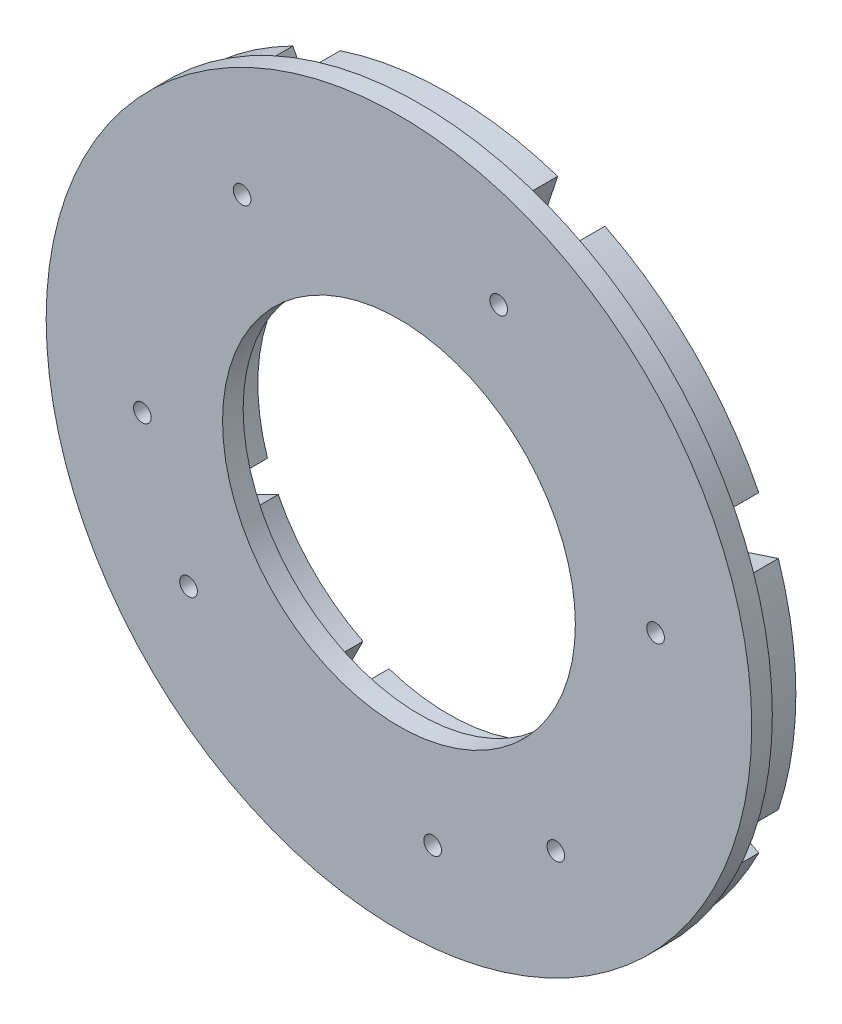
ISO-10303-21;
HEADER;
FILE_DESCRIPTION(('STEP AP214'),'2;1');
FILE_NAME('part.step','',(''),(''),'','','');
FILE_SCHEMA(('AUTOMOTIVE_DESIGN { 1 0 10303 214 1 1 1 1 }'));
ENDSEC;
DATA;
#1=APPLICATION_CONTEXT('core data for automotive mechanical design processes');
#2=APPLICATION_PROTOCOL_DEFINITION('international standard','automotive_design',2000,#1);
#3=PRODUCT_CONTEXT('',#1,'mechanical');
#4=PRODUCT('Part','Part','',(#3));
#5=PRODUCT_RELATED_PRODUCT_CATEGORY('part','',(#4));
#6=PRODUCT_DEFINITION_FORMATION('','',#4);
#7=PRODUCT_DEFINITION_CONTEXT('part definition',#1,'design');
#8=PRODUCT_DEFINITION('design','',#6,#7);
#9=PRODUCT_DEFINITION_SHAPE('','',#8);
#10=(LENGTH_UNIT() NAMED_UNIT(*) SI_UNIT(.MILLI.,.METRE.));
#11=(NAMED_UNIT(*) PLANE_ANGLE_UNIT() SI_UNIT($,.RADIAN.));
#12=(NAMED_UNIT(*) SI_UNIT($,.STERADIAN.) SOLID_ANGLE_UNIT());
#13=UNCERTAINTY_MEASURE_WITH_UNIT(LENGTH_MEASURE(1.E-05),#10,'distance_accuracy_value','');
#14=(GEOMETRIC_REPRESENTATION_CONTEXT(3) GLOBAL_UNCERTAINTY_ASSIGNED_CONTEXT((#13)) GLOBAL_UNIT_ASSIGNED_CONTEXT((#10,
#11,#12)) REPRESENTATION_CONTEXT('',''));
#15=CARTESIAN_POINT('',(0.,0.,0.));
#16=DIRECTION('',(0.,0.,1.));
#17=DIRECTION('',(1.,0.,0.));
#18=AXIS2_PLACEMENT_3D('',#15,#16,#17);
#19=CARTESIAN_POINT('',(0.,30.,0.));
#20=DIRECTION('',(0.,0.,1.));
#21=DIRECTION('',(1.,0.,0.));
#22=AXIS2_PLACEMENT_3D('',#19,#20,#21);
#23=PLANE('',#22);
#24=CARTESIAN_POINT('',(16.9694093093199,40.5960484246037,0.));
#25=DIRECTION('',(0.,0.,1.));
#26=DIRECTION('',(1.,0.,0.));
#27=AXIS2_PLACEMENT_3D('',#24,#25,#26);
#28=CIRCLE('',#27,1.5);
#29=CARTESIAN_POINT('',(18.4694093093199,40.5960484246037,0.));
#30=VERTEX_POINT('',#29);
#31=EDGE_CURVE('E563',#30,#30,#28,.T.);
#32=ORIENTED_EDGE('',*,*,#31,.T.);
#33=EDGE_LOOP('',(#32));
#34=FACE_BOUND('',#33,.T.);
#35=CARTESIAN_POINT('',(0.,0.,0.));
#36=DIRECTION('',(0.,0.,1.));
#37=DIRECTION('',(0.,-1.,0.));
#38=AXIS2_PLACEMENT_3D('',#35,#36,#37);
#39=CIRCLE('',#38,32.5);
#40=CARTESIAN_POINT('',(-30.8609799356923,10.190677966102,0.));
#41=VERTEX_POINT('',#40);
#42=CARTESIAN_POINT('',(-30.8609799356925,-10.1906779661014,0.));
#43=VERTEX_POINT('',#42);
#44=EDGE_CURVE('E590',#41,#43,#39,.T.);
#45=ORIENTED_EDGE('',*,*,#44,.F.);
#46=DIRECTION('',(0.949568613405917,-0.313559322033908,0.));
#47=VECTOR('',#46,1.);
#48=CARTESIAN_POINT('',(-30.8609799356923,10.190677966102,0.));
#49=LINE('',#48,#47);
#50=CARTESIAN_POINT('',(-56.0245481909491,18.5000000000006,0.));
#51=VERTEX_POINT('',#50);
#52=EDGE_CURVE('E599',#51,#41,#49,.T.);
#53=ORIENTED_EDGE('',*,*,#52,.F.);
#54=CARTESIAN_POINT('',(0.,0.,0.));
#55=DIRECTION('',(0.,0.,-1.));
#56=DIRECTION('',(0.,-1.,0.));
#57=AXIS2_PLACEMENT_3D('',#54,#55,#56);
#58=CIRCLE('',#57,59.);
#59=CARTESIAN_POINT('',(-56.0245481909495,-18.4999999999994,0.));
#60=VERTEX_POINT('',#59);
#61=EDGE_CURVE('E596',#60,#51,#58,.T.);
#62=ORIENTED_EDGE('',*,*,#61,.F.);
#63=DIRECTION('',(-0.949568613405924,-0.313559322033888,0.));
#64=VECTOR('',#63,1.);
#65=CARTESIAN_POINT('',(-30.8609799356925,-10.1906779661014,0.));
#66=LINE('',#65,#64);
#67=EDGE_CURVE('E593',#43,#60,#66,.T.);
#68=ORIENTED_EDGE('',*,*,#67,.F.);
#69=EDGE_LOOP('',(#45,#53,#62,#68));
#70=FACE_BOUND('',#69,.T.);
#71=CARTESIAN_POINT('',(0.,0.,0.));
#72=DIRECTION('',(0.,0.,1.));
#73=DIRECTION('',(1.,0.,0.));
#74=AXIS2_PLACEMENT_3D('',#71,#72,#73);
#75=CIRCLE('',#74,32.5);
#76=CARTESIAN_POINT('',(-10.1906779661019,-30.8609799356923,0.));
#77=VERTEX_POINT('',#76);
#78=CARTESIAN_POINT('',(10.1906779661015,-30.8609799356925,0.));
#79=VERTEX_POINT('',#78);
#80=EDGE_CURVE('E656',#77,#79,#75,.T.);
#81=ORIENTED_EDGE('',*,*,#80,.F.);
#82=DIRECTION('',(0.313559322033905,0.949568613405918,0.));
#83=VECTOR('',#82,1.);
#84=CARTESIAN_POINT('',(-10.1906779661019,-30.8609799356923,0.));
#85=LINE('',#84,#83);
#86=CARTESIAN_POINT('',(-18.5000000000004,-56.0245481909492,0.));
#87=VERTEX_POINT('',#86);
#88=EDGE_CURVE('E665',#87,#77,#85,.T.);
#89=ORIENTED_EDGE('',*,*,#88,.F.);
#90=CARTESIAN_POINT('',(0.,0.,0.));
#91=DIRECTION('',(0.,0.,-1.));
#92=DIRECTION('',(1.,0.,0.));
#93=AXIS2_PLACEMENT_3D('',#90,#91,#92);
#94=CIRCLE('',#93,59.);
#95=CARTESIAN_POINT('',(18.4999999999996,-56.0245481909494,0.));
#96=VERTEX_POINT('',#95);
#97=EDGE_CURVE('E662',#96,#87,#94,.T.);
#98=ORIENTED_EDGE('',*,*,#97,.F.);
#99=DIRECTION('',(0.313559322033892,-0.949568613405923,0.));
#100=VECTOR('',#99,1.);
#101=CARTESIAN_POINT('',(10.1906779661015,-30.8609799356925,0.));
#102=LINE('',#101,#100);
#103=EDGE_CURVE('E659',#79,#96,#102,.T.);
#104=ORIENTED_EDGE('',*,*,#103,.F.);
#105=EDGE_LOOP('',(#81,#89,#98,#104));
#106=FACE_BOUND('',#105,.T.);
#107=CARTESIAN_POINT('',(0.,0.,0.));
#108=DIRECTION('',(0.,0.,1.));
#109=DIRECTION('',(0.,1.,0.));
#110=AXIS2_PLACEMENT_3D('',#107,#108,#109);
#111=CIRCLE('',#110,32.5);
#112=CARTESIAN_POINT('',(30.8609799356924,-10.1906779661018,0.));
#113=VERTEX_POINT('',#112);
#114=CARTESIAN_POINT('',(30.8609799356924,10.1906779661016,0.));
#115=VERTEX_POINT('',#114);
#116=EDGE_CURVE('E722',#113,#115,#111,.T.);
#117=ORIENTED_EDGE('',*,*,#116,.F.);
#118=DIRECTION('',(-0.949568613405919,0.313559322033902,0.));
#119=VECTOR('',#118,1.);
#120=CARTESIAN_POINT('',(30.8609799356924,-10.1906779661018,0.));
#121=LINE('',#120,#119);
#122=CARTESIAN_POINT('',(56.0245481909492,-18.5000000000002,0.));
#123=VERTEX_POINT('',#122);
#124=EDGE_CURVE('E731',#123,#113,#121,.T.);
#125=ORIENTED_EDGE('',*,*,#124,.F.);
#126=CARTESIAN_POINT('',(0.,0.,0.));
#127=DIRECTION('',(0.,0.,-1.));
#128=DIRECTION('',(0.,1.,0.));
#129=AXIS2_PLACEMENT_3D('',#126,#127,#128);
#130=CIRCLE('',#129,59.);
#131=CARTESIAN_POINT('',(56.0245481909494,18.4999999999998,0.));
#132=VERTEX_POINT('',#131);
#133=EDGE_CURVE('E728',#132,#123,#130,.T.);
#134=ORIENTED_EDGE('',*,*,#133,.F.);
#135=DIRECTION('',(0.949568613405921,0.313559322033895,0.));
#136=VECTOR('',#135,1.);
#137=CARTESIAN_POINT('',(30.8609799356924,10.1906779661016,0.));
#138=LINE('',#137,#136);
#139=EDGE_CURVE('E725',#115,#132,#138,.T.);
#140=ORIENTED_EDGE('',*,*,#139,.F.);
#141=EDGE_LOOP('',(#117,#125,#134,#140));
#142=FACE_BOUND('',#141,.T.);
#143=CARTESIAN_POINT('',(0.,0.,0.));
#144=DIRECTION('',(0.,0.,1.));
#145=DIRECTION('',(-1.,0.,0.));
#146=AXIS2_PLACEMENT_3D('',#143,#144,#145);
#147=CIRCLE('',#146,32.5);
#148=CARTESIAN_POINT('',(10.1906779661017,30.8609799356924,0.));
#149=VERTEX_POINT('',#148);
#150=CARTESIAN_POINT('',(-10.1906779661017,30.8609799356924,0.));
#151=VERTEX_POINT('',#150);
#152=EDGE_CURVE('E788',#149,#151,#147,.T.);
#153=ORIENTED_EDGE('',*,*,#152,.F.);
#154=DIRECTION('',(-0.313559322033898,-0.94956861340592,0.));
#155=VECTOR('',#154,1.);
#156=CARTESIAN_POINT('',(10.1906779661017,30.8609799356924,0.));
#157=LINE('',#156,#155);
#158=CARTESIAN_POINT('',(18.5,56.0245481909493,0.));
#159=VERTEX_POINT('',#158);
#160=EDGE_CURVE('E797',#159,#149,#157,.T.);
#161=ORIENTED_EDGE('',*,*,#160,.F.);
#162=CARTESIAN_POINT('',(0.,0.,0.));
#163=DIRECTION('',(0.,0.,-1.));
#164=DIRECTION('',(-1.,0.,0.));
#165=AXIS2_PLACEMENT_3D('',#162,#163,#164);
#166=CIRCLE('',#165,59.);
#167=CARTESIAN_POINT('',(-18.5,56.0245481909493,0.));
#168=VERTEX_POINT('',#167);
#169=EDGE_CURVE('E794',#168,#159,#166,.T.);
#170=ORIENTED_EDGE('',*,*,#169,.F.);
#171=DIRECTION('',(-0.313559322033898,0.94956861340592,0.));
#172=VECTOR('',#171,1.);
#173=CARTESIAN_POINT('',(-10.1906779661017,30.8609799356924,0.));
#174=LINE('',#173,#172);
#175=EDGE_CURVE('E791',#151,#168,#174,.T.);
#176=ORIENTED_EDGE('',*,*,#175,.F.);
#177=EDGE_LOOP('',(#153,#161,#170,#176));
#178=FACE_BOUND('',#177,.T.);
#179=CARTESIAN_POINT('',(0.,0.,0.));
#180=DIRECTION('',(0.,0.,1.));
#181=DIRECTION('',(1.,0.,0.));
#182=AXIS2_PLACEMENT_3D('',#179,#180,#181);
#183=CIRCLE('',#182,60.);
#184=CARTESIAN_POINT('',(60.,0.,0.));
#185=VERTEX_POINT('',#184);
#186=EDGE_CURVE('E11',#185,#185,#183,.T.);
#187=ORIENTED_EDGE('',*,*,#186,.F.);
#188=EDGE_LOOP('',(#187));
#189=FACE_BOUND('',#188,.T.);
#190=CARTESIAN_POINT('',(0.,0.,0.));
#191=DIRECTION('',(0.,0.,1.));
#192=DIRECTION('',(1.,0.,0.));
#193=AXIS2_PLACEMENT_3D('',#190,#191,#192);
#194=CIRCLE('',#193,30.);
#195=CARTESIAN_POINT('',(30.,0.,0.));
#196=VERTEX_POINT('',#195);
#197=EDGE_CURVE('E821',#196,#196,#194,.T.);
#198=ORIENTED_EDGE('',*,*,#197,.T.);
#199=EDGE_LOOP('',(#198));
#200=FACE_BOUND('',#199,.T.);
#201=CARTESIAN_POINT('',(0.,0.,0.));
#202=DIRECTION('',(0.,0.,1.));
#203=DIRECTION('',(-0.707106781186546,0.707106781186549,0.));
#204=AXIS2_PLACEMENT_3D('',#201,#202,#203);
#205=CIRCLE('',#204,32.5);
#206=CARTESIAN_POINT('',(29.027905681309,14.6161106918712,0.));
#207=VERTEX_POINT('',#206);
#208=CARTESIAN_POINT('',(14.6161106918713,29.0279056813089,0.));
#209=VERTEX_POINT('',#208);
#210=EDGE_CURVE('E755',#207,#209,#205,.T.);
#211=ORIENTED_EDGE('',*,*,#210,.F.);
#212=DIRECTION('',(-0.89316632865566,-0.449726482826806,0.));
#213=VECTOR('',#212,1.);
#214=CARTESIAN_POINT('',(29.027905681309,14.6161106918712,0.));
#215=LINE('',#214,#213);
#216=CARTESIAN_POINT('',(52.6968133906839,26.5338624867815,0.));
#217=VERTEX_POINT('',#216);
#218=EDGE_CURVE('E764',#217,#207,#215,.T.);
#219=ORIENTED_EDGE('',*,*,#218,.F.);
#220=CARTESIAN_POINT('',(0.,0.,0.));
#221=DIRECTION('',(0.,0.,-1.));
#222=DIRECTION('',(-0.707106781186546,0.707106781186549,0.));
#223=AXIS2_PLACEMENT_3D('',#220,#221,#222);
#224=CIRCLE('',#223,59.);
#225=CARTESIAN_POINT('',(26.5338624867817,52.6968133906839,0.));
#226=VERTEX_POINT('',#225);
#227=EDGE_CURVE('E761',#226,#217,#224,.T.);
#228=ORIENTED_EDGE('',*,*,#227,.F.);
#229=DIRECTION('',(0.449726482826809,0.893166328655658,0.));
#230=VECTOR('',#229,1.);
#231=CARTESIAN_POINT('',(14.6161106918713,29.0279056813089,0.));
#232=LINE('',#231,#230);
#233=EDGE_CURVE('E758',#209,#226,#232,.T.);
#234=ORIENTED_EDGE('',*,*,#233,.F.);
#235=EDGE_LOOP('',(#211,#219,#228,#234));
#236=FACE_BOUND('',#235,.T.);
#237=CARTESIAN_POINT('',(0.,0.,0.));
#238=DIRECTION('',(0.,0.,1.));
#239=DIRECTION('',(0.707106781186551,0.707106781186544,0.));
#240=AXIS2_PLACEMENT_3D('',#237,#238,#239);
#241=CIRCLE('',#240,32.5);
#242=CARTESIAN_POINT('',(14.6161106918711,-29.027905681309,0.));
#243=VERTEX_POINT('',#242);
#244=CARTESIAN_POINT('',(29.0279056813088,-14.6161106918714,0.));
#245=VERTEX_POINT('',#244);
#246=EDGE_CURVE('E689',#243,#245,#241,.T.);
#247=ORIENTED_EDGE('',*,*,#246,.F.);
#248=DIRECTION('',(-0.449726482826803,0.893166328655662,0.));
#249=VECTOR('',#248,1.);
#250=CARTESIAN_POINT('',(14.6161106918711,-29.027905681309,0.));
#251=LINE('',#250,#249);
#252=CARTESIAN_POINT('',(26.5338624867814,-52.696813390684,0.));
#253=VERTEX_POINT('',#252);
#254=EDGE_CURVE('E698',#253,#243,#251,.T.);
#255=ORIENTED_EDGE('',*,*,#254,.F.);
#256=CARTESIAN_POINT('',(0.,0.,0.));
#257=DIRECTION('',(0.,0.,-1.));
#258=DIRECTION('',(0.707106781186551,0.707106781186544,0.));
#259=AXIS2_PLACEMENT_3D('',#256,#257,#258);
#260=CIRCLE('',#259,59.);
#261=CARTESIAN_POINT('',(52.6968133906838,-26.5338624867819,0.));
#262=VERTEX_POINT('',#261);
#263=EDGE_CURVE('E695',#262,#253,#260,.T.);
#264=ORIENTED_EDGE('',*,*,#263,.F.);
#265=DIRECTION('',(0.893166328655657,-0.449726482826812,0.));
#266=VECTOR('',#265,1.);
#267=CARTESIAN_POINT('',(29.0279056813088,-14.6161106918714,0.));
#268=LINE('',#267,#266);
#269=EDGE_CURVE('E692',#245,#262,#268,.T.);
#270=ORIENTED_EDGE('',*,*,#269,.F.);
#271=EDGE_LOOP('',(#247,#255,#264,#270));
#272=FACE_BOUND('',#271,.T.);
#273=CARTESIAN_POINT('',(0.,0.,0.));
#274=DIRECTION('',(0.,0.,1.));
#275=DIRECTION('',(0.707106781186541,-0.707106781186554,0.));
#276=AXIS2_PLACEMENT_3D('',#273,#274,#275);
#277=CIRCLE('',#276,32.5);
#278=CARTESIAN_POINT('',(-29.0279056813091,-14.616110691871,0.));
#279=VERTEX_POINT('',#278);
#280=CARTESIAN_POINT('',(-14.6161106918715,-29.0279056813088,0.));
#281=VERTEX_POINT('',#280);
#282=EDGE_CURVE('E623',#279,#281,#277,.T.);
#283=ORIENTED_EDGE('',*,*,#282,.F.);
#284=DIRECTION('',(0.893166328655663,0.4497264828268,0.));
#285=VECTOR('',#284,1.);
#286=CARTESIAN_POINT('',(-29.0279056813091,-14.616110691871,0.));
#287=LINE('',#286,#285);
#288=CARTESIAN_POINT('',(-52.6968133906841,-26.5338624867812,0.));
#289=VERTEX_POINT('',#288);
#290=EDGE_CURVE('E632',#289,#279,#287,.T.);
#291=ORIENTED_EDGE('',*,*,#290,.F.);
#292=CARTESIAN_POINT('',(0.,0.,0.));
#293=DIRECTION('',(0.,0.,-1.));
#294=DIRECTION('',(0.707106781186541,-0.707106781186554,0.));
#295=AXIS2_PLACEMENT_3D('',#292,#293,#294);
#296=CIRCLE('',#295,59.);
#297=CARTESIAN_POINT('',(-26.5338624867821,-52.6968133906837,0.));
#298=VERTEX_POINT('',#297);
#299=EDGE_CURVE('E629',#298,#289,#296,.T.);
#300=ORIENTED_EDGE('',*,*,#299,.F.);
#301=DIRECTION('',(-0.449726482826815,-0.893166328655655,0.));
#302=VECTOR('',#301,1.);
#303=CARTESIAN_POINT('',(-14.6161106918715,-29.0279056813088,0.));
#304=LINE('',#303,#302);
#305=EDGE_CURVE('E626',#281,#298,#304,.T.);
#306=ORIENTED_EDGE('',*,*,#305,.F.);
#307=EDGE_LOOP('',(#283,#291,#300,#306));
#308=FACE_BOUND('',#307,.T.);
#309=CARTESIAN_POINT('',(0.,0.,0.));
#310=DIRECTION('',(0.,0.,1.));
#311=DIRECTION('',(-0.707106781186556,-0.707106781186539,0.));
#312=AXIS2_PLACEMENT_3D('',#309,#310,#311);
#313=CIRCLE('',#312,32.5);
#314=CARTESIAN_POINT('',(-14.6161106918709,29.0279056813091,0.));
#315=VERTEX_POINT('',#314);
#316=CARTESIAN_POINT('',(-29.0279056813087,14.6161106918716,0.));
#317=VERTEX_POINT('',#316);
#318=EDGE_CURVE('E557',#315,#317,#313,.T.);
#319=ORIENTED_EDGE('',*,*,#318,.F.);
#320=DIRECTION('',(0.449726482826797,-0.893166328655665,0.));
#321=VECTOR('',#320,1.);
#322=CARTESIAN_POINT('',(-14.6161106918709,29.0279056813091,0.));
#323=LINE('',#322,#321);
#324=CARTESIAN_POINT('',(-26.533862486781,52.6968133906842,0.));
#325=VERTEX_POINT('',#324);
#326=EDGE_CURVE('E559',#325,#315,#323,.T.);
#327=ORIENTED_EDGE('',*,*,#326,.F.);
#328=CARTESIAN_POINT('',(0.,0.,0.));
#329=DIRECTION('',(0.,0.,-1.));
#330=DIRECTION('',(-0.707106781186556,-0.707106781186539,0.));
#331=AXIS2_PLACEMENT_3D('',#328,#329,#330);
#332=CIRCLE('',#331,59.);
#333=CARTESIAN_POINT('',(-52.6968133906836,26.5338624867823,0.));
#334=VERTEX_POINT('',#333);
#335=EDGE_CURVE('E372',#334,#325,#332,.T.);
#336=ORIENTED_EDGE('',*,*,#335,.F.);
#337=DIRECTION('',(-0.893166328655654,0.449726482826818,0.));
#338=VECTOR('',#337,1.);
#339=CARTESIAN_POINT('',(-29.0279056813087,14.6161106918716,0.));
#340=LINE('',#339,#338);
#341=EDGE_CURVE('E367',#317,#334,#340,.T.);
#342=ORIENTED_EDGE('',*,*,#341,.F.);
#343=EDGE_LOOP('',(#319,#327,#336,#342));
#344=FACE_BOUND('',#343,.T.);
#345=ADVANCED_FACE('F353',(#34,#70,#106,#142,#178,#189,#200,#236,#272,#308,#344),#23,.F.);
#346=CARTESIAN_POINT('',(0.,0.,15.1750798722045));
#347=DIRECTION('',(0.,0.,1.));
#348=DIRECTION('',(1.,0.,0.));
#349=AXIS2_PLACEMENT_3D('',#346,#347,#348);
#350=CYLINDRICAL_SURFACE('',#349,60.);
#351=CARTESIAN_POINT('',(0.,0.,3.5));
#352=DIRECTION('',(0.,0.,1.));
#353=DIRECTION('',(1.,0.,0.));
#354=AXIS2_PLACEMENT_3D('',#351,#352,#353);
#355=CIRCLE('',#354,60.);
#356=CARTESIAN_POINT('',(60.,0.,3.5));
#357=VERTEX_POINT('',#356);
#358=EDGE_CURVE('E360',#357,#357,#355,.T.);
#359=ORIENTED_EDGE('',*,*,#358,.F.);
#360=EDGE_LOOP('',(#359));
#361=FACE_BOUND('',#360,.T.);
#362=ORIENTED_EDGE('',*,*,#186,.T.);
#363=EDGE_LOOP('',(#362));
#364=FACE_BOUND('',#363,.T.);
#365=ADVANCED_FACE('F831',(#361,#364),#350,.T.);
#366=CARTESIAN_POINT('',(0.,30.,3.5));
#367=DIRECTION('',(0.,0.,-1.));
#368=DIRECTION('',(-1.,0.,0.));
#369=AXIS2_PLACEMENT_3D('',#366,#367,#368);
#370=PLANE('',#369);
#371=CARTESIAN_POINT('',(5.72940476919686,-44.6337755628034,3.5));
#372=DIRECTION('',(0.,0.,1.));
#373=DIRECTION('',(1.,0.,0.));
#374=AXIS2_PLACEMENT_3D('',#371,#372,#373);
#375=CIRCLE('',#374,1.5);
#376=CARTESIAN_POINT('',(7.22940476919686,-44.6337755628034,3.5));
#377=VERTEX_POINT('',#376);
#378=EDGE_CURVE('E983',#377,#377,#375,.T.);
#379=ORIENTED_EDGE('',*,*,#378,.F.);
#380=EDGE_LOOP('',(#379));
#381=FACE_BOUND('',#380,.T.);
#382=CARTESIAN_POINT('',(-35.7892811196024,-27.2786978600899,3.5));
#383=DIRECTION('',(0.,0.,1.));
#384=DIRECTION('',(1.,0.,0.));
#385=AXIS2_PLACEMENT_3D('',#382,#383,#384);
#386=CIRCLE('',#385,1.5);
#387=CARTESIAN_POINT('',(-34.2892811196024,-27.2786978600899,3.5));
#388=VERTEX_POINT('',#387);
#389=EDGE_CURVE('E987',#388,#388,#386,.T.);
#390=ORIENTED_EDGE('',*,*,#389,.F.);
#391=EDGE_LOOP('',(#390));
#392=FACE_BOUND('',#391,.T.);
#393=CARTESIAN_POINT('',(-26.6725045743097,34.9939637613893,3.5));
#394=DIRECTION('',(0.,0.,1.));
#395=DIRECTION('',(0.50000000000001,0.866025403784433,0.));
#396=AXIS2_PLACEMENT_3D('',#393,#394,#395);
#397=CIRCLE('',#396,1.5);
#398=CARTESIAN_POINT('',(-25.9225045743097,36.293001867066,3.5));
#399=VERTEX_POINT('',#398);
#400=EDGE_CURVE('E991',#399,#399,#397,.T.);
#401=ORIENTED_EDGE('',*,*,#400,.F.);
#402=EDGE_LOOP('',(#401));
#403=FACE_BOUND('',#402,.T.);
#404=CARTESIAN_POINT('',(-43.64191388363,-5.6020846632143,3.5));
#405=DIRECTION('',(0.,0.,1.));
#406=DIRECTION('',(-0.499999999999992,0.866025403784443,0.));
#407=AXIS2_PLACEMENT_3D('',#404,#405,#406);
#408=CIRCLE('',#407,1.5);
#409=CARTESIAN_POINT('',(-44.39191388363,-4.30304655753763,3.5));
#410=VERTEX_POINT('',#409);
#411=EDGE_CURVE('E995',#410,#410,#408,.T.);
#412=ORIENTED_EDGE('',*,*,#411,.F.);
#413=EDGE_LOOP('',(#412));
#414=FACE_BOUND('',#413,.T.);
#415=CARTESIAN_POINT('',(26.6725045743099,-34.9939637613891,3.5));
#416=DIRECTION('',(0.,0.,1.));
#417=DIRECTION('',(-0.500000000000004,-0.866025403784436,0.));
#418=AXIS2_PLACEMENT_3D('',#415,#416,#417);
#419=CIRCLE('',#418,1.5);
#420=CARTESIAN_POINT('',(25.9225045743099,-36.2930018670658,3.5));
#421=VERTEX_POINT('',#420);
#422=EDGE_CURVE('E999',#421,#421,#419,.T.);
#423=ORIENTED_EDGE('',*,*,#422,.F.);
#424=EDGE_LOOP('',(#423));
#425=FACE_BOUND('',#424,.T.);
#426=CARTESIAN_POINT('',(43.64191388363,5.6020846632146,3.5));
#427=DIRECTION('',(0.,0.,1.));
#428=DIRECTION('',(0.499999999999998,-0.86602540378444,0.));
#429=AXIS2_PLACEMENT_3D('',#426,#427,#428);
#430=CIRCLE('',#429,1.5);
#431=CARTESIAN_POINT('',(44.39191388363,4.30304655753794,3.5));
#432=VERTEX_POINT('',#431);
#433=EDGE_CURVE('E1003',#432,#432,#430,.T.);
#434=ORIENTED_EDGE('',*,*,#433,.F.);
#435=EDGE_LOOP('',(#434));
#436=FACE_BOUND('',#435,.T.);
#437=CARTESIAN_POINT('',(16.9694093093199,40.5960484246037,3.5));
#438=DIRECTION('',(0.,0.,1.));
#439=DIRECTION('',(1.,0.,0.));
#440=AXIS2_PLACEMENT_3D('',#437,#438,#439);
#441=CIRCLE('',#440,1.5);
#442=CARTESIAN_POINT('',(18.4694093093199,40.5960484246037,3.5));
#443=VERTEX_POINT('',#442);
#444=EDGE_CURVE('E1007',#443,#443,#441,.T.);
#445=ORIENTED_EDGE('',*,*,#444,.F.);
#446=EDGE_LOOP('',(#445));
#447=FACE_BOUND('',#446,.T.);
#448=CARTESIAN_POINT('',(0.,0.,3.5));
#449=DIRECTION('',(0.,0.,1.));
#450=DIRECTION('',(1.,0.,0.));
#451=AXIS2_PLACEMENT_3D('',#448,#449,#450);
#452=CIRCLE('',#451,30.);
#453=CARTESIAN_POINT('',(30.,0.,3.5));
#454=VERTEX_POINT('',#453);
#455=EDGE_CURVE('E824',#454,#454,#452,.T.);
#456=ORIENTED_EDGE('',*,*,#455,.F.);
#457=EDGE_LOOP('',(#456));
#458=FACE_BOUND('',#457,.T.);
#459=ORIENTED_EDGE('',*,*,#358,.T.);
#460=EDGE_LOOP('',(#459));
#461=FACE_BOUND('',#460,.T.);
#462=ADVANCED_FACE('F829',(#381,#392,#403,#414,#425,#436,#447,#458,#461),#370,.F.);
#463=CARTESIAN_POINT('',(0.,0.,15.1750798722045));
#464=DIRECTION('',(0.,0.,1.));
#465=DIRECTION('',(1.,0.,0.));
#466=AXIS2_PLACEMENT_3D('',#463,#464,#465);
#467=CYLINDRICAL_SURFACE('',#466,30.);
#468=ORIENTED_EDGE('',*,*,#197,.F.);
#469=EDGE_LOOP('',(#468));
#470=FACE_BOUND('',#469,.T.);
#471=ORIENTED_EDGE('',*,*,#455,.T.);
#472=EDGE_LOOP('',(#471));
#473=FACE_BOUND('',#472,.T.);
#474=ADVANCED_FACE('F969',(#470,#473),#467,.F.);
#475=CARTESIAN_POINT('',(0.,0.,-5.));
#476=DIRECTION('',(0.,0.,1.));
#477=DIRECTION('',(1.,0.,0.));
#478=AXIS2_PLACEMENT_3D('',#475,#476,#477);
#479=CYLINDRICAL_SURFACE('',#478,32.5);
#480=ORIENTED_EDGE('',*,*,#152,.T.);
#481=DIRECTION('',(0.,0.,1.));
#482=VECTOR('',#481,1.);
#483=CARTESIAN_POINT('',(-10.1906779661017,30.8609799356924,-5.));
#484=LINE('',#483,#482);
#485=CARTESIAN_POINT('',(-10.1906779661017,30.8609799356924,-5.));
#486=VERTEX_POINT('',#485);
#487=EDGE_CURVE('E818',#486,#151,#484,.T.);
#488=ORIENTED_EDGE('',*,*,#487,.F.);
#489=CARTESIAN_POINT('',(0.,0.,-5.));
#490=DIRECTION('',(0.,0.,1.));
#491=DIRECTION('',(-1.,0.,0.));
#492=AXIS2_PLACEMENT_3D('',#489,#490,#491);
#493=CIRCLE('',#492,32.5);
#494=CARTESIAN_POINT('',(10.1906779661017,30.8609799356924,-5.));
#495=VERTEX_POINT('',#494);
#496=EDGE_CURVE('E800',#495,#486,#493,.T.);
#497=ORIENTED_EDGE('',*,*,#496,.F.);
#498=DIRECTION('',(0.,0.,1.));
#499=VECTOR('',#498,1.);
#500=CARTESIAN_POINT('',(10.1906779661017,30.8609799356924,-5.));
#501=LINE('',#500,#499);
#502=EDGE_CURVE('E809',#495,#149,#501,.T.);
#503=ORIENTED_EDGE('',*,*,#502,.T.);
#504=EDGE_LOOP('',(#480,#488,#497,#503));
#505=FACE_BOUND('',#504,.T.);
#506=ADVANCED_FACE('F965',(#505),#479,.F.);
#507=CARTESIAN_POINT('',(-10.1906779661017,30.8609799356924,-5.));
#508=DIRECTION('',(0.94956861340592,0.313559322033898,0.));
#509=DIRECTION('',(-0.313559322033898,0.94956861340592,0.));
#510=AXIS2_PLACEMENT_3D('',#507,#508,#509);
#511=PLANE('',#510);
#512=ORIENTED_EDGE('',*,*,#175,.T.);
#513=DIRECTION('',(0.,0.,1.));
#514=VECTOR('',#513,1.);
#515=CARTESIAN_POINT('',(-18.5,56.0245481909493,-5.));
#516=LINE('',#515,#514);
#517=CARTESIAN_POINT('',(-18.5,56.0245481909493,-5.));
#518=VERTEX_POINT('',#517);
#519=EDGE_CURVE('E815',#518,#168,#516,.T.);
#520=ORIENTED_EDGE('',*,*,#519,.F.);
#521=DIRECTION('',(-0.313559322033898,0.94956861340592,0.));
#522=VECTOR('',#521,1.);
#523=CARTESIAN_POINT('',(-10.1906779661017,30.8609799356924,-5.));
#524=LINE('',#523,#522);
#525=EDGE_CURVE('E803',#486,#518,#524,.T.);
#526=ORIENTED_EDGE('',*,*,#525,.F.);
#527=ORIENTED_EDGE('',*,*,#487,.T.);
#528=EDGE_LOOP('',(#512,#520,#526,#527));
#529=FACE_BOUND('',#528,.T.);
#530=ADVANCED_FACE('F961',(#529),#511,.F.);
#531=CARTESIAN_POINT('',(0.,0.,-5.));
#532=DIRECTION('',(0.,0.,1.));
#533=DIRECTION('',(1.,0.,0.));
#534=AXIS2_PLACEMENT_3D('',#531,#532,#533);
#535=CYLINDRICAL_SURFACE('',#534,59.);
#536=ORIENTED_EDGE('',*,*,#169,.T.);
#537=DIRECTION('',(0.,0.,1.));
#538=VECTOR('',#537,1.);
#539=CARTESIAN_POINT('',(18.5,56.0245481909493,-5.));
#540=LINE('',#539,#538);
#541=CARTESIAN_POINT('',(18.5,56.0245481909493,-5.));
#542=VERTEX_POINT('',#541);
#543=EDGE_CURVE('E812',#542,#159,#540,.T.);
#544=ORIENTED_EDGE('',*,*,#543,.F.);
#545=CARTESIAN_POINT('',(0.,0.,-5.));
#546=DIRECTION('',(0.,0.,-1.));
#547=DIRECTION('',(-1.,0.,0.));
#548=AXIS2_PLACEMENT_3D('',#545,#546,#547);
#549=CIRCLE('',#548,59.);
#550=EDGE_CURVE('E805',#518,#542,#549,.T.);
#551=ORIENTED_EDGE('',*,*,#550,.F.);
#552=ORIENTED_EDGE('',*,*,#519,.T.);
#553=EDGE_LOOP('',(#536,#544,#551,#552));
#554=FACE_BOUND('',#553,.T.);
#555=ADVANCED_FACE('F957',(#554),#535,.T.);
#556=CARTESIAN_POINT('',(10.1906779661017,30.8609799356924,-5.));
#557=DIRECTION('',(-0.94956861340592,0.313559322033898,0.));
#558=DIRECTION('',(-0.313559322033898,-0.94956861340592,0.));
#559=AXIS2_PLACEMENT_3D('',#556,#557,#558);
#560=PLANE('',#559);
#561=ORIENTED_EDGE('',*,*,#160,.T.);
#562=ORIENTED_EDGE('',*,*,#502,.F.);
#563=DIRECTION('',(-0.313559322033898,-0.94956861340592,0.));
#564=VECTOR('',#563,1.);
#565=CARTESIAN_POINT('',(10.1906779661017,30.8609799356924,-5.));
#566=LINE('',#565,#564);
#567=EDGE_CURVE('E807',#542,#495,#566,.T.);
#568=ORIENTED_EDGE('',*,*,#567,.F.);
#569=ORIENTED_EDGE('',*,*,#543,.T.);
#570=EDGE_LOOP('',(#561,#562,#568,#569));
#571=FACE_BOUND('',#570,.T.);
#572=ADVANCED_FACE('F953',(#571),#560,.F.);
#573=CARTESIAN_POINT('',(0.,0.,-5.));
#574=DIRECTION('',(0.,0.,-1.));
#575=DIRECTION('',(-1.,0.,0.));
#576=AXIS2_PLACEMENT_3D('',#573,#574,#575);
#577=PLANE('',#576);
#578=ORIENTED_EDGE('',*,*,#496,.T.);
#579=ORIENTED_EDGE('',*,*,#525,.T.);
#580=ORIENTED_EDGE('',*,*,#550,.T.);
#581=ORIENTED_EDGE('',*,*,#567,.T.);
#582=EDGE_LOOP('',(#578,#579,#580,#581));
#583=FACE_BOUND('',#582,.T.);
#584=ADVANCED_FACE('F949',(#583),#577,.T.);
#585=CARTESIAN_POINT('',(0.,0.,-5.));
#586=DIRECTION('',(0.,0.,1.));
#587=DIRECTION('',(1.,0.,0.));
#588=AXIS2_PLACEMENT_3D('',#585,#586,#587);
#589=CYLINDRICAL_SURFACE('',#588,32.5);
#590=ORIENTED_EDGE('',*,*,#210,.T.);
#591=DIRECTION('',(0.,0.,1.));
#592=VECTOR('',#591,1.);
#593=CARTESIAN_POINT('',(14.6161106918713,29.0279056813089,-5.));
#594=LINE('',#593,#592);
#595=CARTESIAN_POINT('',(14.6161106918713,29.0279056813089,-5.));
#596=VERTEX_POINT('',#595);
#597=EDGE_CURVE('E785',#596,#209,#594,.T.);
#598=ORIENTED_EDGE('',*,*,#597,.F.);
#599=CARTESIAN_POINT('',(0.,0.,-5.));
#600=DIRECTION('',(0.,0.,1.));
#601=DIRECTION('',(-0.707106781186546,0.707106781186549,0.));
#602=AXIS2_PLACEMENT_3D('',#599,#600,#601);
#603=CIRCLE('',#602,32.5);
#604=CARTESIAN_POINT('',(29.027905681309,14.6161106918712,-5.));
#605=VERTEX_POINT('',#604);
#606=EDGE_CURVE('E767',#605,#596,#603,.T.);
#607=ORIENTED_EDGE('',*,*,#606,.F.);
#608=DIRECTION('',(0.,0.,1.));
#609=VECTOR('',#608,1.);
#610=CARTESIAN_POINT('',(29.027905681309,14.6161106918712,-5.));
#611=LINE('',#610,#609);
#612=EDGE_CURVE('E776',#605,#207,#611,.T.);
#613=ORIENTED_EDGE('',*,*,#612,.T.);
#614=EDGE_LOOP('',(#590,#598,#607,#613));
#615=FACE_BOUND('',#614,.T.);
#616=ADVANCED_FACE('F945',(#615),#589,.F.);
#617=CARTESIAN_POINT('',(14.6161106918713,29.0279056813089,-5.));
#618=DIRECTION('',(0.893166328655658,-0.449726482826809,0.));
#619=DIRECTION('',(0.449726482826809,0.893166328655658,0.));
#620=AXIS2_PLACEMENT_3D('',#617,#618,#619);
#621=PLANE('',#620);
#622=ORIENTED_EDGE('',*,*,#233,.T.);
#623=DIRECTION('',(0.,0.,1.));
#624=VECTOR('',#623,1.);
#625=CARTESIAN_POINT('',(26.5338624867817,52.6968133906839,-5.));
#626=LINE('',#625,#624);
#627=CARTESIAN_POINT('',(26.5338624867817,52.6968133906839,-5.));
#628=VERTEX_POINT('',#627);
#629=EDGE_CURVE('E782',#628,#226,#626,.T.);
#630=ORIENTED_EDGE('',*,*,#629,.F.);
#631=DIRECTION('',(0.449726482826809,0.893166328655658,0.));
#632=VECTOR('',#631,1.);
#633=CARTESIAN_POINT('',(14.6161106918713,29.0279056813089,-5.));
#634=LINE('',#633,#632);
#635=EDGE_CURVE('E770',#596,#628,#634,.T.);
#636=ORIENTED_EDGE('',*,*,#635,.F.);
#637=ORIENTED_EDGE('',*,*,#597,.T.);
#638=EDGE_LOOP('',(#622,#630,#636,#637));
#639=FACE_BOUND('',#638,.T.);
#640=ADVANCED_FACE('F941',(#639),#621,.F.);
#641=CARTESIAN_POINT('',(0.,0.,-5.));
#642=DIRECTION('',(0.,0.,1.));
#643=DIRECTION('',(1.,0.,0.));
#644=AXIS2_PLACEMENT_3D('',#641,#642,#643);
#645=CYLINDRICAL_SURFACE('',#644,59.);
#646=ORIENTED_EDGE('',*,*,#227,.T.);
#647=DIRECTION('',(0.,0.,1.));
#648=VECTOR('',#647,1.);
#649=CARTESIAN_POINT('',(52.6968133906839,26.5338624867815,-5.));
#650=LINE('',#649,#648);
#651=CARTESIAN_POINT('',(52.6968133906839,26.5338624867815,-5.));
#652=VERTEX_POINT('',#651);
#653=EDGE_CURVE('E779',#652,#217,#650,.T.);
#654=ORIENTED_EDGE('',*,*,#653,.F.);
#655=CARTESIAN_POINT('',(0.,0.,-5.));
#656=DIRECTION('',(0.,0.,-1.));
#657=DIRECTION('',(-0.707106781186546,0.707106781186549,0.));
#658=AXIS2_PLACEMENT_3D('',#655,#656,#657);
#659=CIRCLE('',#658,59.);
#660=EDGE_CURVE('E772',#628,#652,#659,.T.);
#661=ORIENTED_EDGE('',*,*,#660,.F.);
#662=ORIENTED_EDGE('',*,*,#629,.T.);
#663=EDGE_LOOP('',(#646,#654,#661,#662));
#664=FACE_BOUND('',#663,.T.);
#665=ADVANCED_FACE('F937',(#664),#645,.T.);
#666=CARTESIAN_POINT('',(29.027905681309,14.6161106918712,-5.));
#667=DIRECTION('',(-0.449726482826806,0.89316632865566,0.));
#668=DIRECTION('',(-0.89316632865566,-0.449726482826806,0.));
#669=AXIS2_PLACEMENT_3D('',#666,#667,#668);
#670=PLANE('',#669);
#671=ORIENTED_EDGE('',*,*,#218,.T.);
#672=ORIENTED_EDGE('',*,*,#612,.F.);
#673=DIRECTION('',(-0.89316632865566,-0.449726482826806,0.));
#674=VECTOR('',#673,1.);
#675=CARTESIAN_POINT('',(29.027905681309,14.6161106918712,-5.));
#676=LINE('',#675,#674);
#677=EDGE_CURVE('E774',#652,#605,#676,.T.);
#678=ORIENTED_EDGE('',*,*,#677,.F.);
#679=ORIENTED_EDGE('',*,*,#653,.T.);
#680=EDGE_LOOP('',(#671,#672,#678,#679));
#681=FACE_BOUND('',#680,.T.);
#682=ADVANCED_FACE('F933',(#681),#670,.F.);
#683=CARTESIAN_POINT('',(0.,0.,-5.));
#684=DIRECTION('',(0.,0.,-1.));
#685=DIRECTION('',(-0.707106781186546,0.707106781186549,0.));
#686=AXIS2_PLACEMENT_3D('',#683,#684,#685);
#687=PLANE('',#686);
#688=ORIENTED_EDGE('',*,*,#606,.T.);
#689=ORIENTED_EDGE('',*,*,#635,.T.);
#690=ORIENTED_EDGE('',*,*,#660,.T.);
#691=ORIENTED_EDGE('',*,*,#677,.T.);
#692=EDGE_LOOP('',(#688,#689,#690,#691));
#693=FACE_BOUND('',#692,.T.);
#694=ADVANCED_FACE('F929',(#693),#687,.T.);
#695=CARTESIAN_POINT('',(0.,0.,-5.));
#696=DIRECTION('',(0.,0.,1.));
#697=DIRECTION('',(1.,0.,0.));
#698=AXIS2_PLACEMENT_3D('',#695,#696,#697);
#699=CYLINDRICAL_SURFACE('',#698,32.5);
#700=ORIENTED_EDGE('',*,*,#116,.T.);
#701=DIRECTION('',(0.,0.,1.));
#702=VECTOR('',#701,1.);
#703=CARTESIAN_POINT('',(30.8609799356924,10.1906779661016,-5.));
#704=LINE('',#703,#702);
#705=CARTESIAN_POINT('',(30.8609799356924,10.1906779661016,-5.));
#706=VERTEX_POINT('',#705);
#707=EDGE_CURVE('E752',#706,#115,#704,.T.);
#708=ORIENTED_EDGE('',*,*,#707,.F.);
#709=CARTESIAN_POINT('',(0.,0.,-5.));
#710=DIRECTION('',(0.,0.,1.));
#711=DIRECTION('',(0.,1.,0.));
#712=AXIS2_PLACEMENT_3D('',#709,#710,#711);
#713=CIRCLE('',#712,32.5);
#714=CARTESIAN_POINT('',(30.8609799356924,-10.1906779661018,-5.));
#715=VERTEX_POINT('',#714);
#716=EDGE_CURVE('E734',#715,#706,#713,.T.);
#717=ORIENTED_EDGE('',*,*,#716,.F.);
#718=DIRECTION('',(0.,0.,1.));
#719=VECTOR('',#718,1.);
#720=CARTESIAN_POINT('',(30.8609799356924,-10.1906779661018,-5.));
#721=LINE('',#720,#719);
#722=EDGE_CURVE('E743',#715,#113,#721,.T.);
#723=ORIENTED_EDGE('',*,*,#722,.T.);
#724=EDGE_LOOP('',(#700,#708,#717,#723));
#725=FACE_BOUND('',#724,.T.);
#726=ADVANCED_FACE('F925',(#725),#699,.F.);
#727=CARTESIAN_POINT('',(30.8609799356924,10.1906779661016,-5.));
#728=DIRECTION('',(0.313559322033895,-0.949568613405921,0.));
#729=DIRECTION('',(0.949568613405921,0.313559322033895,0.));
#730=AXIS2_PLACEMENT_3D('',#727,#728,#729);
#731=PLANE('',#730);
#732=ORIENTED_EDGE('',*,*,#139,.T.);
#733=DIRECTION('',(0.,0.,1.));
#734=VECTOR('',#733,1.);
#735=CARTESIAN_POINT('',(56.0245481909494,18.4999999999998,-5.));
#736=LINE('',#735,#734);
#737=CARTESIAN_POINT('',(56.0245481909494,18.4999999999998,-5.));
#738=VERTEX_POINT('',#737);
#739=EDGE_CURVE('E749',#738,#132,#736,.T.);
#740=ORIENTED_EDGE('',*,*,#739,.F.);
#741=DIRECTION('',(0.949568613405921,0.313559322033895,0.));
#742=VECTOR('',#741,1.);
#743=CARTESIAN_POINT('',(30.8609799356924,10.1906779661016,-5.));
#744=LINE('',#743,#742);
#745=EDGE_CURVE('E737',#706,#738,#744,.T.);
#746=ORIENTED_EDGE('',*,*,#745,.F.);
#747=ORIENTED_EDGE('',*,*,#707,.T.);
#748=EDGE_LOOP('',(#732,#740,#746,#747));
#749=FACE_BOUND('',#748,.T.);
#750=ADVANCED_FACE('F921',(#749),#731,.F.);
#751=CARTESIAN_POINT('',(0.,0.,-5.));
#752=DIRECTION('',(0.,0.,1.));
#753=DIRECTION('',(1.,0.,0.));
#754=AXIS2_PLACEMENT_3D('',#751,#752,#753);
#755=CYLINDRICAL_SURFACE('',#754,59.);
#756=ORIENTED_EDGE('',*,*,#133,.T.);
#757=DIRECTION('',(0.,0.,1.));
#758=VECTOR('',#757,1.);
#759=CARTESIAN_POINT('',(56.0245481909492,-18.5000000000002,-5.));
#760=LINE('',#759,#758);
#761=CARTESIAN_POINT('',(56.0245481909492,-18.5000000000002,-5.));
#762=VERTEX_POINT('',#761);
#763=EDGE_CURVE('E746',#762,#123,#760,.T.);
#764=ORIENTED_EDGE('',*,*,#763,.F.);
#765=CARTESIAN_POINT('',(0.,0.,-5.));
#766=DIRECTION('',(0.,0.,-1.));
#767=DIRECTION('',(0.,1.,0.));
#768=AXIS2_PLACEMENT_3D('',#765,#766,#767);
#769=CIRCLE('',#768,59.);
#770=EDGE_CURVE('E739',#738,#762,#769,.T.);
#771=ORIENTED_EDGE('',*,*,#770,.F.);
#772=ORIENTED_EDGE('',*,*,#739,.T.);
#773=EDGE_LOOP('',(#756,#764,#771,#772));
#774=FACE_BOUND('',#773,.T.);
#775=ADVANCED_FACE('F917',(#774),#755,.T.);
#776=CARTESIAN_POINT('',(30.8609799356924,-10.1906779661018,-5.));
#777=DIRECTION('',(0.313559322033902,0.949568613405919,0.));
#778=DIRECTION('',(-0.949568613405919,0.313559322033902,0.));
#779=AXIS2_PLACEMENT_3D('',#776,#777,#778);
#780=PLANE('',#779);
#781=ORIENTED_EDGE('',*,*,#124,.T.);
#782=ORIENTED_EDGE('',*,*,#722,.F.);
#783=DIRECTION('',(-0.949568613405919,0.313559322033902,0.));
#784=VECTOR('',#783,1.);
#785=CARTESIAN_POINT('',(30.8609799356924,-10.1906779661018,-5.));
#786=LINE('',#785,#784);
#787=EDGE_CURVE('E741',#762,#715,#786,.T.);
#788=ORIENTED_EDGE('',*,*,#787,.F.);
#789=ORIENTED_EDGE('',*,*,#763,.T.);
#790=EDGE_LOOP('',(#781,#782,#788,#789));
#791=FACE_BOUND('',#790,.T.);
#792=ADVANCED_FACE('F913',(#791),#780,.F.);
#793=CARTESIAN_POINT('',(0.,0.,-5.));
#794=DIRECTION('',(0.,0.,-1.));
#795=DIRECTION('',(0.,1.,0.));
#796=AXIS2_PLACEMENT_3D('',#793,#794,#795);
#797=PLANE('',#796);
#798=ORIENTED_EDGE('',*,*,#716,.T.);
#799=ORIENTED_EDGE('',*,*,#745,.T.);
#800=ORIENTED_EDGE('',*,*,#770,.T.);
#801=ORIENTED_EDGE('',*,*,#787,.T.);
#802=EDGE_LOOP('',(#798,#799,#800,#801));
#803=FACE_BOUND('',#802,.T.);
#804=ADVANCED_FACE('F909',(#803),#797,.T.);
#805=CARTESIAN_POINT('',(0.,0.,-5.));
#806=DIRECTION('',(0.,0.,1.));
#807=DIRECTION('',(1.,0.,0.));
#808=AXIS2_PLACEMENT_3D('',#805,#806,#807);
#809=CYLINDRICAL_SURFACE('',#808,32.5);
#810=ORIENTED_EDGE('',*,*,#246,.T.);
#811=DIRECTION('',(0.,0.,1.));
#812=VECTOR('',#811,1.);
#813=CARTESIAN_POINT('',(29.0279056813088,-14.6161106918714,-5.));
#814=LINE('',#813,#812);
#815=CARTESIAN_POINT('',(29.0279056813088,-14.6161106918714,-5.));
#816=VERTEX_POINT('',#815);
#817=EDGE_CURVE('E719',#816,#245,#814,.T.);
#818=ORIENTED_EDGE('',*,*,#817,.F.);
#819=CARTESIAN_POINT('',(0.,0.,-5.));
#820=DIRECTION('',(0.,0.,1.));
#821=DIRECTION('',(0.707106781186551,0.707106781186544,0.));
#822=AXIS2_PLACEMENT_3D('',#819,#820,#821);
#823=CIRCLE('',#822,32.5);
#824=CARTESIAN_POINT('',(14.6161106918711,-29.027905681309,-5.));
#825=VERTEX_POINT('',#824);
#826=EDGE_CURVE('E701',#825,#816,#823,.T.);
#827=ORIENTED_EDGE('',*,*,#826,.F.);
#828=DIRECTION('',(0.,0.,1.));
#829=VECTOR('',#828,1.);
#830=CARTESIAN_POINT('',(14.6161106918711,-29.027905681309,-5.));
#831=LINE('',#830,#829);
#832=EDGE_CURVE('E710',#825,#243,#831,.T.);
#833=ORIENTED_EDGE('',*,*,#832,.T.);
#834=EDGE_LOOP('',(#810,#818,#827,#833));
#835=FACE_BOUND('',#834,.T.);
#836=ADVANCED_FACE('F905',(#835),#809,.F.);
#837=CARTESIAN_POINT('',(29.0279056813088,-14.6161106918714,-5.));
#838=DIRECTION('',(-0.449726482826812,-0.893166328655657,0.));
#839=DIRECTION('',(0.893166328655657,-0.449726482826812,0.));
#840=AXIS2_PLACEMENT_3D('',#837,#838,#839);
#841=PLANE('',#840);
#842=ORIENTED_EDGE('',*,*,#269,.T.);
#843=DIRECTION('',(0.,0.,1.));
#844=VECTOR('',#843,1.);
#845=CARTESIAN_POINT('',(52.6968133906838,-26.5338624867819,-5.));
#846=LINE('',#845,#844);
#847=CARTESIAN_POINT('',(52.6968133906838,-26.5338624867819,-5.));
#848=VERTEX_POINT('',#847);
#849=EDGE_CURVE('E716',#848,#262,#846,.T.);
#850=ORIENTED_EDGE('',*,*,#849,.F.);
#851=DIRECTION('',(0.893166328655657,-0.449726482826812,0.));
#852=VECTOR('',#851,1.);
#853=CARTESIAN_POINT('',(29.0279056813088,-14.6161106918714,-5.));
#854=LINE('',#853,#852);
#855=EDGE_CURVE('E704',#816,#848,#854,.T.);
#856=ORIENTED_EDGE('',*,*,#855,.F.);
#857=ORIENTED_EDGE('',*,*,#817,.T.);
#858=EDGE_LOOP('',(#842,#850,#856,#857));
#859=FACE_BOUND('',#858,.T.);
#860=ADVANCED_FACE('F901',(#859),#841,.F.);
#861=CARTESIAN_POINT('',(0.,0.,-5.));
#862=DIRECTION('',(0.,0.,1.));
#863=DIRECTION('',(1.,0.,0.));
#864=AXIS2_PLACEMENT_3D('',#861,#862,#863);
#865=CYLINDRICAL_SURFACE('',#864,59.);
#866=ORIENTED_EDGE('',*,*,#263,.T.);
#867=DIRECTION('',(0.,0.,1.));
#868=VECTOR('',#867,1.);
#869=CARTESIAN_POINT('',(26.5338624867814,-52.696813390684,-5.));
#870=LINE('',#869,#868);
#871=CARTESIAN_POINT('',(26.5338624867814,-52.696813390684,-5.));
#872=VERTEX_POINT('',#871);
#873=EDGE_CURVE('E713',#872,#253,#870,.T.);
#874=ORIENTED_EDGE('',*,*,#873,.F.);
#875=CARTESIAN_POINT('',(0.,0.,-5.));
#876=DIRECTION('',(0.,0.,-1.));
#877=DIRECTION('',(0.707106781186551,0.707106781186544,0.));
#878=AXIS2_PLACEMENT_3D('',#875,#876,#877);
#879=CIRCLE('',#878,59.);
#880=EDGE_CURVE('E706',#848,#872,#879,.T.);
#881=ORIENTED_EDGE('',*,*,#880,.F.);
#882=ORIENTED_EDGE('',*,*,#849,.T.);
#883=EDGE_LOOP('',(#866,#874,#881,#882));
#884=FACE_BOUND('',#883,.T.);
#885=ADVANCED_FACE('F897',(#884),#865,.T.);
#886=CARTESIAN_POINT('',(14.6161106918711,-29.027905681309,-5.));
#887=DIRECTION('',(0.893166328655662,0.449726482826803,0.));
#888=DIRECTION('',(-0.449726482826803,0.893166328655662,0.));
#889=AXIS2_PLACEMENT_3D('',#886,#887,#888);
#890=PLANE('',#889);
#891=ORIENTED_EDGE('',*,*,#254,.T.);
#892=ORIENTED_EDGE('',*,*,#832,.F.);
#893=DIRECTION('',(-0.449726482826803,0.893166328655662,0.));
#894=VECTOR('',#893,1.);
#895=CARTESIAN_POINT('',(14.6161106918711,-29.027905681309,-5.));
#896=LINE('',#895,#894);
#897=EDGE_CURVE('E708',#872,#825,#896,.T.);
#898=ORIENTED_EDGE('',*,*,#897,.F.);
#899=ORIENTED_EDGE('',*,*,#873,.T.);
#900=EDGE_LOOP('',(#891,#892,#898,#899));
#901=FACE_BOUND('',#900,.T.);
#902=ADVANCED_FACE('F893',(#901),#890,.F.);
#903=CARTESIAN_POINT('',(0.,0.,-5.));
#904=DIRECTION('',(0.,0.,-1.));
#905=DIRECTION('',(0.707106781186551,0.707106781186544,0.));
#906=AXIS2_PLACEMENT_3D('',#903,#904,#905);
#907=PLANE('',#906);
#908=ORIENTED_EDGE('',*,*,#826,.T.);
#909=ORIENTED_EDGE('',*,*,#855,.T.);
#910=ORIENTED_EDGE('',*,*,#880,.T.);
#911=ORIENTED_EDGE('',*,*,#897,.T.);
#912=EDGE_LOOP('',(#908,#909,#910,#911));
#913=FACE_BOUND('',#912,.T.);
#914=ADVANCED_FACE('F889',(#913),#907,.T.);
#915=CARTESIAN_POINT('',(0.,0.,-5.));
#916=DIRECTION('',(0.,0.,1.));
#917=DIRECTION('',(1.,0.,0.));
#918=AXIS2_PLACEMENT_3D('',#915,#916,#917);
#919=CYLINDRICAL_SURFACE('',#918,32.5);
#920=ORIENTED_EDGE('',*,*,#80,.T.);
#921=DIRECTION('',(0.,0.,1.));
#922=VECTOR('',#921,1.);
#923=CARTESIAN_POINT('',(10.1906779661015,-30.8609799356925,-5.));
#924=LINE('',#923,#922);
#925=CARTESIAN_POINT('',(10.1906779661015,-30.8609799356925,-5.));
#926=VERTEX_POINT('',#925);
#927=EDGE_CURVE('E686',#926,#79,#924,.T.);
#928=ORIENTED_EDGE('',*,*,#927,.F.);
#929=CARTESIAN_POINT('',(0.,0.,-5.));
#930=DIRECTION('',(0.,0.,1.));
#931=DIRECTION('',(1.,0.,0.));
#932=AXIS2_PLACEMENT_3D('',#929,#930,#931);
#933=CIRCLE('',#932,32.5);
#934=CARTESIAN_POINT('',(-10.1906779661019,-30.8609799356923,-5.));
#935=VERTEX_POINT('',#934);
#936=EDGE_CURVE('E668',#935,#926,#933,.T.);
#937=ORIENTED_EDGE('',*,*,#936,.F.);
#938=DIRECTION('',(0.,0.,1.));
#939=VECTOR('',#938,1.);
#940=CARTESIAN_POINT('',(-10.1906779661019,-30.8609799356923,-5.));
#941=LINE('',#940,#939);
#942=EDGE_CURVE('E677',#935,#77,#941,.T.);
#943=ORIENTED_EDGE('',*,*,#942,.T.);
#944=EDGE_LOOP('',(#920,#928,#937,#943));
#945=FACE_BOUND('',#944,.T.);
#946=ADVANCED_FACE('F885',(#945),#919,.F.);
#947=CARTESIAN_POINT('',(10.1906779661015,-30.8609799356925,-5.));
#948=DIRECTION('',(-0.949568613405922,-0.313559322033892,0.));
#949=DIRECTION('',(0.313559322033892,-0.949568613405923,0.));
#950=AXIS2_PLACEMENT_3D('',#947,#948,#949);
#951=PLANE('',#950);
#952=ORIENTED_EDGE('',*,*,#103,.T.);
#953=DIRECTION('',(0.,0.,1.));
#954=VECTOR('',#953,1.);
#955=CARTESIAN_POINT('',(18.4999999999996,-56.0245481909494,-5.));
#956=LINE('',#955,#954);
#957=CARTESIAN_POINT('',(18.4999999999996,-56.0245481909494,-5.));
#958=VERTEX_POINT('',#957);
#959=EDGE_CURVE('E683',#958,#96,#956,.T.);
#960=ORIENTED_EDGE('',*,*,#959,.F.);
#961=DIRECTION('',(0.313559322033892,-0.949568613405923,0.));
#962=VECTOR('',#961,1.);
#963=CARTESIAN_POINT('',(10.1906779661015,-30.8609799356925,-5.));
#964=LINE('',#963,#962);
#965=EDGE_CURVE('E671',#926,#958,#964,.T.);
#966=ORIENTED_EDGE('',*,*,#965,.F.);
#967=ORIENTED_EDGE('',*,*,#927,.T.);
#968=EDGE_LOOP('',(#952,#960,#966,#967));
#969=FACE_BOUND('',#968,.T.);
#970=ADVANCED_FACE('F881',(#969),#951,.F.);
#971=CARTESIAN_POINT('',(0.,0.,-5.));
#972=DIRECTION('',(0.,0.,1.));
#973=DIRECTION('',(1.,0.,0.));
#974=AXIS2_PLACEMENT_3D('',#971,#972,#973);
#975=CYLINDRICAL_SURFACE('',#974,59.);
#976=ORIENTED_EDGE('',*,*,#97,.T.);
#977=DIRECTION('',(0.,0.,1.));
#978=VECTOR('',#977,1.);
#979=CARTESIAN_POINT('',(-18.5000000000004,-56.0245481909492,-5.));
#980=LINE('',#979,#978);
#981=CARTESIAN_POINT('',(-18.5000000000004,-56.0245481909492,-5.));
#982=VERTEX_POINT('',#981);
#983=EDGE_CURVE('E680',#982,#87,#980,.T.);
#984=ORIENTED_EDGE('',*,*,#983,.F.);
#985=CARTESIAN_POINT('',(0.,0.,-5.));
#986=DIRECTION('',(0.,0.,-1.));
#987=DIRECTION('',(1.,0.,0.));
#988=AXIS2_PLACEMENT_3D('',#985,#986,#987);
#989=CIRCLE('',#988,59.);
#990=EDGE_CURVE('E673',#958,#982,#989,.T.);
#991=ORIENTED_EDGE('',*,*,#990,.F.);
#992=ORIENTED_EDGE('',*,*,#959,.T.);
#993=EDGE_LOOP('',(#976,#984,#991,#992));
#994=FACE_BOUND('',#993,.T.);
#995=ADVANCED_FACE('F877',(#994),#975,.T.);
#996=CARTESIAN_POINT('',(-10.1906779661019,-30.8609799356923,-5.));
#997=DIRECTION('',(0.949568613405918,-0.313559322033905,0.));
#998=DIRECTION('',(0.313559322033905,0.949568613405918,0.));
#999=AXIS2_PLACEMENT_3D('',#996,#997,#998);
#1000=PLANE('',#999);
#1001=ORIENTED_EDGE('',*,*,#88,.T.);
#1002=ORIENTED_EDGE('',*,*,#942,.F.);
#1003=DIRECTION('',(0.313559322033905,0.949568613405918,0.));
#1004=VECTOR('',#1003,1.);
#1005=CARTESIAN_POINT('',(-10.1906779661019,-30.8609799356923,-5.));
#1006=LINE('',#1005,#1004);
#1007=EDGE_CURVE('E675',#982,#935,#1006,.T.);
#1008=ORIENTED_EDGE('',*,*,#1007,.F.);
#1009=ORIENTED_EDGE('',*,*,#983,.T.);
#1010=EDGE_LOOP('',(#1001,#1002,#1008,#1009));
#1011=FACE_BOUND('',#1010,.T.);
#1012=ADVANCED_FACE('F873',(#1011),#1000,.F.);
#1013=CARTESIAN_POINT('',(0.,0.,-5.));
#1014=DIRECTION('',(0.,0.,-1.));
#1015=DIRECTION('',(1.,0.,0.));
#1016=AXIS2_PLACEMENT_3D('',#1013,#1014,#1015);
#1017=PLANE('',#1016);
#1018=ORIENTED_EDGE('',*,*,#936,.T.);
#1019=ORIENTED_EDGE('',*,*,#965,.T.);
#1020=ORIENTED_EDGE('',*,*,#990,.T.);
#1021=ORIENTED_EDGE('',*,*,#1007,.T.);
#1022=EDGE_LOOP('',(#1018,#1019,#1020,#1021));
#1023=FACE_BOUND('',#1022,.T.);
#1024=ADVANCED_FACE('F867',(#1023),#1017,.T.);
#1025=CARTESIAN_POINT('',(0.,0.,-5.));
#1026=DIRECTION('',(0.,0.,1.));
#1027=DIRECTION('',(1.,0.,0.));
#1028=AXIS2_PLACEMENT_3D('',#1025,#1026,#1027);
#1029=CYLINDRICAL_SURFACE('',#1028,32.5);
#1030=ORIENTED_EDGE('',*,*,#282,.T.);
#1031=DIRECTION('',(0.,0.,1.));
#1032=VECTOR('',#1031,1.);
#1033=CARTESIAN_POINT('',(-14.6161106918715,-29.0279056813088,-5.));
#1034=LINE('',#1033,#1032);
#1035=CARTESIAN_POINT('',(-14.6161106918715,-29.0279056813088,-5.));
#1036=VERTEX_POINT('',#1035);
#1037=EDGE_CURVE('E653',#1036,#281,#1034,.T.);
#1038=ORIENTED_EDGE('',*,*,#1037,.F.);
#1039=CARTESIAN_POINT('',(0.,0.,-5.));
#1040=DIRECTION('',(0.,0.,1.));
#1041=DIRECTION('',(0.707106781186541,-0.707106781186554,0.));
#1042=AXIS2_PLACEMENT_3D('',#1039,#1040,#1041);
#1043=CIRCLE('',#1042,32.5);
#1044=CARTESIAN_POINT('',(-29.0279056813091,-14.616110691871,-5.));
#1045=VERTEX_POINT('',#1044);
#1046=EDGE_CURVE('E635',#1045,#1036,#1043,.T.);
#1047=ORIENTED_EDGE('',*,*,#1046,.F.);
#1048=DIRECTION('',(0.,0.,1.));
#1049=VECTOR('',#1048,1.);
#1050=CARTESIAN_POINT('',(-29.0279056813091,-14.616110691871,-5.));
#1051=LINE('',#1050,#1049);
#1052=EDGE_CURVE('E644',#1045,#279,#1051,.T.);
#1053=ORIENTED_EDGE('',*,*,#1052,.T.);
#1054=EDGE_LOOP('',(#1030,#1038,#1047,#1053));
#1055=FACE_BOUND('',#1054,.T.);
#1056=ADVANCED_FACE('F851',(#1055),#1029,.F.);
#1057=CARTESIAN_POINT('',(-14.6161106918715,-29.0279056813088,-5.));
#1058=DIRECTION('',(-0.893166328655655,0.449726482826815,0.));
#1059=DIRECTION('',(-0.449726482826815,-0.893166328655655,0.));
#1060=AXIS2_PLACEMENT_3D('',#1057,#1058,#1059);
#1061=PLANE('',#1060);
#1062=ORIENTED_EDGE('',*,*,#305,.T.);
#1063=DIRECTION('',(0.,0.,1.));
#1064=VECTOR('',#1063,1.);
#1065=CARTESIAN_POINT('',(-26.5338624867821,-52.6968133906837,-5.));
#1066=LINE('',#1065,#1064);
#1067=CARTESIAN_POINT('',(-26.5338624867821,-52.6968133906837,-5.));
#1068=VERTEX_POINT('',#1067);
#1069=EDGE_CURVE('E650',#1068,#298,#1066,.T.);
#1070=ORIENTED_EDGE('',*,*,#1069,.F.);
#1071=DIRECTION('',(-0.449726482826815,-0.893166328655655,0.));
#1072=VECTOR('',#1071,1.);
#1073=CARTESIAN_POINT('',(-14.6161106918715,-29.0279056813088,-5.));
#1074=LINE('',#1073,#1072);
#1075=EDGE_CURVE('E638',#1036,#1068,#1074,.T.);
#1076=ORIENTED_EDGE('',*,*,#1075,.F.);
#1077=ORIENTED_EDGE('',*,*,#1037,.T.);
#1078=EDGE_LOOP('',(#1062,#1070,#1076,#1077));
#1079=FACE_BOUND('',#1078,.T.);
#1080=ADVANCED_FACE('F859',(#1079),#1061,.F.);
#1081=CARTESIAN_POINT('',(0.,0.,-5.));
#1082=DIRECTION('',(0.,0.,1.));
#1083=DIRECTION('',(1.,0.,0.));
#1084=AXIS2_PLACEMENT_3D('',#1081,#1082,#1083);
#1085=CYLINDRICAL_SURFACE('',#1084,59.);
#1086=ORIENTED_EDGE('',*,*,#299,.T.);
#1087=DIRECTION('',(0.,0.,1.));
#1088=VECTOR('',#1087,1.);
#1089=CARTESIAN_POINT('',(-52.6968133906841,-26.5338624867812,-5.));
#1090=LINE('',#1089,#1088);
#1091=CARTESIAN_POINT('',(-52.6968133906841,-26.5338624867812,-5.));
#1092=VERTEX_POINT('',#1091);
#1093=EDGE_CURVE('E647',#1092,#289,#1090,.T.);
#1094=ORIENTED_EDGE('',*,*,#1093,.F.);
#1095=CARTESIAN_POINT('',(0.,0.,-5.));
#1096=DIRECTION('',(0.,0.,-1.));
#1097=DIRECTION('',(0.707106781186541,-0.707106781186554,0.));
#1098=AXIS2_PLACEMENT_3D('',#1095,#1096,#1097);
#1099=CIRCLE('',#1098,59.);
#1100=EDGE_CURVE('E640',#1068,#1092,#1099,.T.);
#1101=ORIENTED_EDGE('',*,*,#1100,.F.);
#1102=ORIENTED_EDGE('',*,*,#1069,.T.);
#1103=EDGE_LOOP('',(#1086,#1094,#1101,#1102));
#1104=FACE_BOUND('',#1103,.T.);
#1105=ADVANCED_FACE('F857',(#1104),#1085,.T.);
#1106=CARTESIAN_POINT('',(-29.0279056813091,-14.616110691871,-5.));
#1107=DIRECTION('',(0.4497264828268,-0.893166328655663,0.));
#1108=DIRECTION('',(0.893166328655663,0.4497264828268,0.));
#1109=AXIS2_PLACEMENT_3D('',#1106,#1107,#1108);
#1110=PLANE('',#1109);
#1111=ORIENTED_EDGE('',*,*,#290,.T.);
#1112=ORIENTED_EDGE('',*,*,#1052,.F.);
#1113=DIRECTION('',(0.893166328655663,0.4497264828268,0.));
#1114=VECTOR('',#1113,1.);
#1115=CARTESIAN_POINT('',(-29.0279056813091,-14.616110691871,-5.));
#1116=LINE('',#1115,#1114);
#1117=EDGE_CURVE('E642',#1092,#1045,#1116,.T.);
#1118=ORIENTED_EDGE('',*,*,#1117,.F.);
#1119=ORIENTED_EDGE('',*,*,#1093,.T.);
#1120=EDGE_LOOP('',(#1111,#1112,#1118,#1119));
#1121=FACE_BOUND('',#1120,.T.);
#1122=ADVANCED_FACE('F847',(#1121),#1110,.F.);
#1123=CARTESIAN_POINT('',(0.,0.,-5.));
#1124=DIRECTION('',(0.,0.,-1.));
#1125=DIRECTION('',(0.707106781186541,-0.707106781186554,0.));
#1126=AXIS2_PLACEMENT_3D('',#1123,#1124,#1125);
#1127=PLANE('',#1126);
#1128=ORIENTED_EDGE('',*,*,#1046,.T.);
#1129=ORIENTED_EDGE('',*,*,#1075,.T.);
#1130=ORIENTED_EDGE('',*,*,#1100,.T.);
#1131=ORIENTED_EDGE('',*,*,#1117,.T.);
#1132=EDGE_LOOP('',(#1128,#1129,#1130,#1131));
#1133=FACE_BOUND('',#1132,.T.);
#1134=ADVANCED_FACE('F853',(#1133),#1127,.T.);
#1135=CARTESIAN_POINT('',(0.,0.,-5.));
#1136=DIRECTION('',(0.,0.,1.));
#1137=DIRECTION('',(1.,0.,0.));
#1138=AXIS2_PLACEMENT_3D('',#1135,#1136,#1137);
#1139=CYLINDRICAL_SURFACE('',#1138,32.5);
#1140=ORIENTED_EDGE('',*,*,#44,.T.);
#1141=DIRECTION('',(0.,0.,1.));
#1142=VECTOR('',#1141,1.);
#1143=CARTESIAN_POINT('',(-30.8609799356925,-10.1906779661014,-5.));
#1144=LINE('',#1143,#1142);
#1145=CARTESIAN_POINT('',(-30.8609799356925,-10.1906779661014,-5.));
#1146=VERTEX_POINT('',#1145);
#1147=EDGE_CURVE('E620',#1146,#43,#1144,.T.);
#1148=ORIENTED_EDGE('',*,*,#1147,.F.);
#1149=CARTESIAN_POINT('',(0.,0.,-5.));
#1150=DIRECTION('',(0.,0.,1.));
#1151=DIRECTION('',(0.,-1.,0.));
#1152=AXIS2_PLACEMENT_3D('',#1149,#1150,#1151);
#1153=CIRCLE('',#1152,32.5);
#1154=CARTESIAN_POINT('',(-30.8609799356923,10.190677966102,-5.));
#1155=VERTEX_POINT('',#1154);
#1156=EDGE_CURVE('E602',#1155,#1146,#1153,.T.);
#1157=ORIENTED_EDGE('',*,*,#1156,.F.);
#1158=DIRECTION('',(0.,0.,1.));
#1159=VECTOR('',#1158,1.);
#1160=CARTESIAN_POINT('',(-30.8609799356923,10.190677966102,-5.));
#1161=LINE('',#1160,#1159);
#1162=EDGE_CURVE('E611',#1155,#41,#1161,.T.);
#1163=ORIENTED_EDGE('',*,*,#1162,.T.);
#1164=EDGE_LOOP('',(#1140,#1148,#1157,#1163));
#1165=FACE_BOUND('',#1164,.T.);
#1166=ADVANCED_FACE('F1056',(#1165),#1139,.F.);
#1167=CARTESIAN_POINT('',(-30.8609799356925,-10.1906779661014,-5.));
#1168=DIRECTION('',(-0.313559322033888,0.949568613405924,0.));
#1169=DIRECTION('',(-0.949568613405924,-0.313559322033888,0.));
#1170=AXIS2_PLACEMENT_3D('',#1167,#1168,#1169);
#1171=PLANE('',#1170);
#1172=ORIENTED_EDGE('',*,*,#67,.T.);
#1173=DIRECTION('',(0.,0.,1.));
#1174=VECTOR('',#1173,1.);
#1175=CARTESIAN_POINT('',(-56.0245481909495,-18.4999999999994,-5.));
#1176=LINE('',#1175,#1174);
#1177=CARTESIAN_POINT('',(-56.0245481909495,-18.4999999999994,-5.));
#1178=VERTEX_POINT('',#1177);
#1179=EDGE_CURVE('E617',#1178,#60,#1176,.T.);
#1180=ORIENTED_EDGE('',*,*,#1179,.F.);
#1181=DIRECTION('',(-0.949568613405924,-0.313559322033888,0.));
#1182=VECTOR('',#1181,1.);
#1183=CARTESIAN_POINT('',(-30.8609799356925,-10.1906779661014,-5.));
#1184=LINE('',#1183,#1182);
#1185=EDGE_CURVE('E605',#1146,#1178,#1184,.T.);
#1186=ORIENTED_EDGE('',*,*,#1185,.F.);
#1187=ORIENTED_EDGE('',*,*,#1147,.T.);
#1188=EDGE_LOOP('',(#1172,#1180,#1186,#1187));
#1189=FACE_BOUND('',#1188,.T.);
#1190=ADVANCED_FACE('F1052',(#1189),#1171,.F.);
#1191=CARTESIAN_POINT('',(0.,0.,-5.));
#1192=DIRECTION('',(0.,0.,1.));
#1193=DIRECTION('',(1.,0.,0.));
#1194=AXIS2_PLACEMENT_3D('',#1191,#1192,#1193);
#1195=CYLINDRICAL_SURFACE('',#1194,59.);
#1196=ORIENTED_EDGE('',*,*,#61,.T.);
#1197=DIRECTION('',(0.,0.,1.));
#1198=VECTOR('',#1197,1.);
#1199=CARTESIAN_POINT('',(-56.0245481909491,18.5000000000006,-5.));
#1200=LINE('',#1199,#1198);
#1201=CARTESIAN_POINT('',(-56.0245481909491,18.5000000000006,-5.));
#1202=VERTEX_POINT('',#1201);
#1203=EDGE_CURVE('E614',#1202,#51,#1200,.T.);
#1204=ORIENTED_EDGE('',*,*,#1203,.F.);
#1205=CARTESIAN_POINT('',(0.,0.,-5.));
#1206=DIRECTION('',(0.,0.,-1.));
#1207=DIRECTION('',(0.,-1.,0.));
#1208=AXIS2_PLACEMENT_3D('',#1205,#1206,#1207);
#1209=CIRCLE('',#1208,59.);
#1210=EDGE_CURVE('E607',#1178,#1202,#1209,.T.);
#1211=ORIENTED_EDGE('',*,*,#1210,.F.);
#1212=ORIENTED_EDGE('',*,*,#1179,.T.);
#1213=EDGE_LOOP('',(#1196,#1204,#1211,#1212));
#1214=FACE_BOUND('',#1213,.T.);
#1215=ADVANCED_FACE('F1048',(#1214),#1195,.T.);
#1216=CARTESIAN_POINT('',(-30.8609799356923,10.190677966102,-5.));
#1217=DIRECTION('',(-0.313559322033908,-0.949568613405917,0.));
#1218=DIRECTION('',(0.949568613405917,-0.313559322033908,0.));
#1219=AXIS2_PLACEMENT_3D('',#1216,#1217,#1218);
#1220=PLANE('',#1219);
#1221=ORIENTED_EDGE('',*,*,#52,.T.);
#1222=ORIENTED_EDGE('',*,*,#1162,.F.);
#1223=DIRECTION('',(0.949568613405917,-0.313559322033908,0.));
#1224=VECTOR('',#1223,1.);
#1225=CARTESIAN_POINT('',(-30.8609799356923,10.190677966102,-5.));
#1226=LINE('',#1225,#1224);
#1227=EDGE_CURVE('E609',#1202,#1155,#1226,.T.);
#1228=ORIENTED_EDGE('',*,*,#1227,.F.);
#1229=ORIENTED_EDGE('',*,*,#1203,.T.);
#1230=EDGE_LOOP('',(#1221,#1222,#1228,#1229));
#1231=FACE_BOUND('',#1230,.T.);
#1232=ADVANCED_FACE('F1044',(#1231),#1220,.F.);
#1233=CARTESIAN_POINT('',(0.,0.,-5.));
#1234=DIRECTION('',(0.,0.,-1.));
#1235=DIRECTION('',(0.,-1.,0.));
#1236=AXIS2_PLACEMENT_3D('',#1233,#1234,#1235);
#1237=PLANE('',#1236);
#1238=ORIENTED_EDGE('',*,*,#1156,.T.);
#1239=ORIENTED_EDGE('',*,*,#1185,.T.);
#1240=ORIENTED_EDGE('',*,*,#1210,.T.);
#1241=ORIENTED_EDGE('',*,*,#1227,.T.);
#1242=EDGE_LOOP('',(#1238,#1239,#1240,#1241));
#1243=FACE_BOUND('',#1242,.T.);
#1244=ADVANCED_FACE('F1038',(#1243),#1237,.T.);
#1245=CARTESIAN_POINT('',(0.,0.,-5.));
#1246=DIRECTION('',(0.,0.,1.));
#1247=DIRECTION('',(1.,0.,0.));
#1248=AXIS2_PLACEMENT_3D('',#1245,#1246,#1247);
#1249=CYLINDRICAL_SURFACE('',#1248,32.5);
#1250=ORIENTED_EDGE('',*,*,#318,.T.);
#1251=DIRECTION('',(0.,0.,1.));
#1252=VECTOR('',#1251,1.);
#1253=CARTESIAN_POINT('',(-29.0279056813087,14.6161106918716,-5.));
#1254=LINE('',#1253,#1252);
#1255=CARTESIAN_POINT('',(-29.0279056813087,14.6161106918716,-5.));
#1256=VERTEX_POINT('',#1255);
#1257=EDGE_CURVE('E588',#1256,#317,#1254,.T.);
#1258=ORIENTED_EDGE('',*,*,#1257,.F.);
#1259=CARTESIAN_POINT('',(0.,0.,-5.));
#1260=DIRECTION('',(0.,0.,1.));
#1261=DIRECTION('',(-0.707106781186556,-0.707106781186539,0.));
#1262=AXIS2_PLACEMENT_3D('',#1259,#1260,#1261);
#1263=CIRCLE('',#1262,32.5);
#1264=CARTESIAN_POINT('',(-14.6161106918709,29.0279056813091,-5.));
#1265=VERTEX_POINT('',#1264);
#1266=EDGE_CURVE('E574',#1265,#1256,#1263,.T.);
#1267=ORIENTED_EDGE('',*,*,#1266,.F.);
#1268=DIRECTION('',(0.,0.,1.));
#1269=VECTOR('',#1268,1.);
#1270=CARTESIAN_POINT('',(-14.6161106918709,29.0279056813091,-5.));
#1271=LINE('',#1270,#1269);
#1272=EDGE_CURVE('E570',#1265,#315,#1271,.T.);
#1273=ORIENTED_EDGE('',*,*,#1272,.T.);
#1274=EDGE_LOOP('',(#1250,#1258,#1267,#1273));
#1275=FACE_BOUND('',#1274,.T.);
#1276=ADVANCED_FACE('F576',(#1275),#1249,.F.);
#1277=CARTESIAN_POINT('',(-29.0279056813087,14.6161106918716,-5.));
#1278=DIRECTION('',(0.449726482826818,0.893166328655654,0.));
#1279=DIRECTION('',(-0.893166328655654,0.449726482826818,0.));
#1280=AXIS2_PLACEMENT_3D('',#1277,#1278,#1279);
#1281=PLANE('',#1280);
#1282=ORIENTED_EDGE('',*,*,#341,.T.);
#1283=DIRECTION('',(0.,0.,1.));
#1284=VECTOR('',#1283,1.);
#1285=CARTESIAN_POINT('',(-52.6968133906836,26.5338624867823,-5.));
#1286=LINE('',#1285,#1284);
#1287=CARTESIAN_POINT('',(-52.6968133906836,26.5338624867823,-5.));
#1288=VERTEX_POINT('',#1287);
#1289=EDGE_CURVE('E580',#1288,#334,#1286,.T.);
#1290=ORIENTED_EDGE('',*,*,#1289,.F.);
#1291=DIRECTION('',(-0.893166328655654,0.449726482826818,0.));
#1292=VECTOR('',#1291,1.);
#1293=CARTESIAN_POINT('',(-29.0279056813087,14.6161106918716,-5.));
#1294=LINE('',#1293,#1292);
#1295=EDGE_CURVE('E1022',#1256,#1288,#1294,.T.);
#1296=ORIENTED_EDGE('',*,*,#1295,.F.);
#1297=ORIENTED_EDGE('',*,*,#1257,.T.);
#1298=EDGE_LOOP('',(#1282,#1290,#1296,#1297));
#1299=FACE_BOUND('',#1298,.T.);
#1300=ADVANCED_FACE('F1030',(#1299),#1281,.F.);
#1301=CARTESIAN_POINT('',(0.,0.,-5.));
#1302=DIRECTION('',(0.,0.,1.));
#1303=DIRECTION('',(1.,0.,0.));
#1304=AXIS2_PLACEMENT_3D('',#1301,#1302,#1303);
#1305=CYLINDRICAL_SURFACE('',#1304,59.);
#1306=ORIENTED_EDGE('',*,*,#335,.T.);
#1307=DIRECTION('',(0.,0.,1.));
#1308=VECTOR('',#1307,1.);
#1309=CARTESIAN_POINT('',(-26.533862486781,52.6968133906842,-5.));
#1310=LINE('',#1309,#1308);
#1311=CARTESIAN_POINT('',(-26.533862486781,52.6968133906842,-5.));
#1312=VERTEX_POINT('',#1311);
#1313=EDGE_CURVE('E573',#1312,#325,#1310,.T.);
#1314=ORIENTED_EDGE('',*,*,#1313,.F.);
#1315=CARTESIAN_POINT('',(0.,0.,-5.));
#1316=DIRECTION('',(0.,0.,-1.));
#1317=DIRECTION('',(-0.707106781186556,-0.707106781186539,0.));
#1318=AXIS2_PLACEMENT_3D('',#1315,#1316,#1317);
#1319=CIRCLE('',#1318,59.);
#1320=EDGE_CURVE('E582',#1288,#1312,#1319,.T.);
#1321=ORIENTED_EDGE('',*,*,#1320,.F.);
#1322=ORIENTED_EDGE('',*,*,#1289,.T.);
#1323=EDGE_LOOP('',(#1306,#1314,#1321,#1322));
#1324=FACE_BOUND('',#1323,.T.);
#1325=ADVANCED_FACE('F1028',(#1324),#1305,.T.);
#1326=CARTESIAN_POINT('',(-14.6161106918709,29.0279056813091,-5.));
#1327=DIRECTION('',(-0.893166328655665,-0.449726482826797,0.));
#1328=DIRECTION('',(0.449726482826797,-0.893166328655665,0.));
#1329=AXIS2_PLACEMENT_3D('',#1326,#1327,#1328);
#1330=PLANE('',#1329);
#1331=ORIENTED_EDGE('',*,*,#326,.T.);
#1332=ORIENTED_EDGE('',*,*,#1272,.F.);
#1333=DIRECTION('',(0.449726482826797,-0.893166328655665,0.));
#1334=VECTOR('',#1333,1.);
#1335=CARTESIAN_POINT('',(-14.6161106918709,29.0279056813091,-5.));
#1336=LINE('',#1335,#1334);
#1337=EDGE_CURVE('E578',#1312,#1265,#1336,.T.);
#1338=ORIENTED_EDGE('',*,*,#1337,.F.);
#1339=ORIENTED_EDGE('',*,*,#1313,.T.);
#1340=EDGE_LOOP('',(#1331,#1332,#1338,#1339));
#1341=FACE_BOUND('',#1340,.T.);
#1342=ADVANCED_FACE('F568',(#1341),#1330,.F.);
#1343=CARTESIAN_POINT('',(0.,0.,-5.));
#1344=DIRECTION('',(0.,0.,-1.));
#1345=DIRECTION('',(-0.707106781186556,-0.707106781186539,0.));
#1346=AXIS2_PLACEMENT_3D('',#1343,#1344,#1345);
#1347=PLANE('',#1346);
#1348=ORIENTED_EDGE('',*,*,#1266,.T.);
#1349=ORIENTED_EDGE('',*,*,#1295,.T.);
#1350=ORIENTED_EDGE('',*,*,#1320,.T.);
#1351=ORIENTED_EDGE('',*,*,#1337,.T.);
#1352=EDGE_LOOP('',(#1348,#1349,#1350,#1351));
#1353=FACE_BOUND('',#1352,.T.);
#1354=ADVANCED_FACE('F1025',(#1353),#1347,.T.);
#1355=CARTESIAN_POINT('',(16.9694093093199,40.5960484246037,0.));
#1356=DIRECTION('',(0.,0.,1.));
#1357=DIRECTION('',(1.,0.,0.));
#1358=AXIS2_PLACEMENT_3D('',#1355,#1356,#1357);
#1359=CYLINDRICAL_SURFACE('',#1358,1.5);
#1360=ORIENTED_EDGE('',*,*,#31,.F.);
#1361=EDGE_LOOP('',(#1360));
#1362=FACE_BOUND('',#1361,.T.);
#1363=ORIENTED_EDGE('',*,*,#444,.T.);
#1364=EDGE_LOOP('',(#1363));
#1365=FACE_BOUND('',#1364,.T.);
#1366=ADVANCED_FACE('F1113',(#1362,#1365),#1359,.F.);
#1367=CARTESIAN_POINT('',(43.64191388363,5.6020846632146,0.));
#1368=DIRECTION('',(0.,0.,1.));
#1369=DIRECTION('',(1.,0.,0.));
#1370=AXIS2_PLACEMENT_3D('',#1367,#1368,#1369);
#1371=CYLINDRICAL_SURFACE('',#1370,1.5);
#1372=CARTESIAN_POINT('',(43.64191388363,5.6020846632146,0.));
#1373=DIRECTION('',(0.,0.,1.));
#1374=DIRECTION('',(0.499999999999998,-0.86602540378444,0.));
#1375=AXIS2_PLACEMENT_3D('',#1372,#1373,#1374);
#1376=CIRCLE('',#1375,1.5);
#1377=CARTESIAN_POINT('',(44.39191388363,4.30304655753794,0.));
#1378=VERTEX_POINT('',#1377);
#1379=EDGE_CURVE('E1011',#1378,#1378,#1376,.T.);
#1380=ORIENTED_EDGE('',*,*,#1379,.F.);
#1381=EDGE_LOOP('',(#1380));
#1382=FACE_BOUND('',#1381,.T.);
#1383=ORIENTED_EDGE('',*,*,#433,.T.);
#1384=EDGE_LOOP('',(#1383));
#1385=FACE_BOUND('',#1384,.T.);
#1386=ADVANCED_FACE('F1120',(#1382,#1385),#1371,.F.);
#1387=CARTESIAN_POINT('',(43.64191388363,5.6020846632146,0.));
#1388=DIRECTION('',(0.,0.,1.));
#1389=DIRECTION('',(0.499999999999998,-0.86602540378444,0.));
#1390=AXIS2_PLACEMENT_3D('',#1387,#1388,#1389);
#1391=PLANE('',#1390);
#1392=ORIENTED_EDGE('',*,*,#1379,.T.);
#1393=EDGE_LOOP('',(#1392));
#1394=FACE_BOUND('',#1393,.T.);
#1395=ADVANCED_FACE('F1128',(#1394),#1391,.T.);
#1396=CARTESIAN_POINT('',(26.6725045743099,-34.9939637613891,0.));
#1397=DIRECTION('',(0.,0.,1.));
#1398=DIRECTION('',(1.,0.,0.));
#1399=AXIS2_PLACEMENT_3D('',#1396,#1397,#1398);
#1400=CYLINDRICAL_SURFACE('',#1399,1.5);
#1401=CARTESIAN_POINT('',(26.6725045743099,-34.9939637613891,0.));
#1402=DIRECTION('',(0.,0.,1.));
#1403=DIRECTION('',(-0.500000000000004,-0.866025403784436,0.));
#1404=AXIS2_PLACEMENT_3D('',#1401,#1402,#1403);
#1405=CIRCLE('',#1404,1.5);
#1406=CARTESIAN_POINT('',(25.9225045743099,-36.2930018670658,0.));
#1407=VERTEX_POINT('',#1406);
#1408=EDGE_CURVE('E1235',#1407,#1407,#1405,.T.);
#1409=ORIENTED_EDGE('',*,*,#1408,.F.);
#1410=EDGE_LOOP('',(#1409));
#1411=FACE_BOUND('',#1410,.T.);
#1412=ORIENTED_EDGE('',*,*,#422,.T.);
#1413=EDGE_LOOP('',(#1412));
#1414=FACE_BOUND('',#1413,.T.);
#1415=ADVANCED_FACE('F1136',(#1411,#1414),#1400,.F.);
#1416=CARTESIAN_POINT('',(26.6725045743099,-34.9939637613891,0.));
#1417=DIRECTION('',(0.,0.,1.));
#1418=DIRECTION('',(-0.500000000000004,-0.866025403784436,0.));
#1419=AXIS2_PLACEMENT_3D('',#1416,#1417,#1418);
#1420=PLANE('',#1419);
#1421=ORIENTED_EDGE('',*,*,#1408,.T.);
#1422=EDGE_LOOP('',(#1421));
#1423=FACE_BOUND('',#1422,.T.);
#1424=ADVANCED_FACE('F1144',(#1423),#1420,.T.);
#1425=CARTESIAN_POINT('',(-43.64191388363,-5.6020846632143,0.));
#1426=DIRECTION('',(0.,0.,1.));
#1427=DIRECTION('',(1.,0.,0.));
#1428=AXIS2_PLACEMENT_3D('',#1425,#1426,#1427);
#1429=CYLINDRICAL_SURFACE('',#1428,1.5);
#1430=CARTESIAN_POINT('',(-43.64191388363,-5.6020846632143,0.));
#1431=DIRECTION('',(0.,0.,1.));
#1432=DIRECTION('',(-0.499999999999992,0.866025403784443,0.));
#1433=AXIS2_PLACEMENT_3D('',#1430,#1431,#1432);
#1434=CIRCLE('',#1433,1.5);
#1435=CARTESIAN_POINT('',(-44.39191388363,-4.30304655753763,0.));
#1436=VERTEX_POINT('',#1435);
#1437=EDGE_CURVE('E1231',#1436,#1436,#1434,.T.);
#1438=ORIENTED_EDGE('',*,*,#1437,.F.);
#1439=EDGE_LOOP('',(#1438));
#1440=FACE_BOUND('',#1439,.T.);
#1441=ORIENTED_EDGE('',*,*,#411,.T.);
#1442=EDGE_LOOP('',(#1441));
#1443=FACE_BOUND('',#1442,.T.);
#1444=ADVANCED_FACE('F1152',(#1440,#1443),#1429,.F.);
#1445=CARTESIAN_POINT('',(-43.64191388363,-5.6020846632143,0.));
#1446=DIRECTION('',(0.,0.,1.));
#1447=DIRECTION('',(-0.499999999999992,0.866025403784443,0.));
#1448=AXIS2_PLACEMENT_3D('',#1445,#1446,#1447);
#1449=PLANE('',#1448);
#1450=ORIENTED_EDGE('',*,*,#1437,.T.);
#1451=EDGE_LOOP('',(#1450));
#1452=FACE_BOUND('',#1451,.T.);
#1453=ADVANCED_FACE('F1160',(#1452),#1449,.T.);
#1454=CARTESIAN_POINT('',(-26.6725045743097,34.9939637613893,0.));
#1455=DIRECTION('',(0.,0.,1.));
#1456=DIRECTION('',(1.,0.,0.));
#1457=AXIS2_PLACEMENT_3D('',#1454,#1455,#1456);
#1458=CYLINDRICAL_SURFACE('',#1457,1.5);
#1459=CARTESIAN_POINT('',(-26.6725045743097,34.9939637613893,0.));
#1460=DIRECTION('',(0.,0.,1.));
#1461=DIRECTION('',(0.50000000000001,0.866025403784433,0.));
#1462=AXIS2_PLACEMENT_3D('',#1459,#1460,#1461);
#1463=CIRCLE('',#1462,1.5);
#1464=CARTESIAN_POINT('',(-25.9225045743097,36.293001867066,0.));
#1465=VERTEX_POINT('',#1464);
#1466=EDGE_CURVE('E1227',#1465,#1465,#1463,.T.);
#1467=ORIENTED_EDGE('',*,*,#1466,.F.);
#1468=EDGE_LOOP('',(#1467));
#1469=FACE_BOUND('',#1468,.T.);
#1470=ORIENTED_EDGE('',*,*,#400,.T.);
#1471=EDGE_LOOP('',(#1470));
#1472=FACE_BOUND('',#1471,.T.);
#1473=ADVANCED_FACE('F1168',(#1469,#1472),#1458,.F.);
#1474=CARTESIAN_POINT('',(-26.6725045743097,34.9939637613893,0.));
#1475=DIRECTION('',(0.,0.,1.));
#1476=DIRECTION('',(0.50000000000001,0.866025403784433,0.));
#1477=AXIS2_PLACEMENT_3D('',#1474,#1475,#1476);
#1478=PLANE('',#1477);
#1479=ORIENTED_EDGE('',*,*,#1466,.T.);
#1480=EDGE_LOOP('',(#1479));
#1481=FACE_BOUND('',#1480,.T.);
#1482=ADVANCED_FACE('F1176',(#1481),#1478,.T.);
#1483=CARTESIAN_POINT('',(-35.7892811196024,-27.2786978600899,0.));
#1484=DIRECTION('',(0.,0.,1.));
#1485=DIRECTION('',(1.,0.,0.));
#1486=AXIS2_PLACEMENT_3D('',#1483,#1484,#1485);
#1487=CYLINDRICAL_SURFACE('',#1486,1.5);
#1488=CARTESIAN_POINT('',(-35.7892811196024,-27.2786978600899,0.));
#1489=DIRECTION('',(0.,0.,1.));
#1490=DIRECTION('',(1.,0.,0.));
#1491=AXIS2_PLACEMENT_3D('',#1488,#1489,#1490);
#1492=CIRCLE('',#1491,1.5);
#1493=CARTESIAN_POINT('',(-34.2892811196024,-27.2786978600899,0.));
#1494=VERTEX_POINT('',#1493);
#1495=EDGE_CURVE('E1220',#1494,#1494,#1492,.T.);
#1496=ORIENTED_EDGE('',*,*,#1495,.F.);
#1497=EDGE_LOOP('',(#1496));
#1498=FACE_BOUND('',#1497,.T.);
#1499=ORIENTED_EDGE('',*,*,#389,.T.);
#1500=EDGE_LOOP('',(#1499));
#1501=FACE_BOUND('',#1500,.T.);
#1502=ADVANCED_FACE('F1183',(#1498,#1501),#1487,.F.);
#1503=CARTESIAN_POINT('',(-35.7892811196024,-27.2786978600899,0.));
#1504=DIRECTION('',(0.,0.,1.));
#1505=DIRECTION('',(1.,0.,0.));
#1506=AXIS2_PLACEMENT_3D('',#1503,#1504,#1505);
#1507=PLANE('',#1506);
#1508=ORIENTED_EDGE('',*,*,#1495,.T.);
#1509=EDGE_LOOP('',(#1508));
#1510=FACE_BOUND('',#1509,.T.);
#1511=ADVANCED_FACE('F1190',(#1510),#1507,.T.);
#1512=CARTESIAN_POINT('',(5.72940476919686,-44.6337755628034,0.));
#1513=DIRECTION('',(0.,0.,1.));
#1514=DIRECTION('',(1.,0.,0.));
#1515=AXIS2_PLACEMENT_3D('',#1512,#1513,#1514);
#1516=CYLINDRICAL_SURFACE('',#1515,1.5);
#1517=CARTESIAN_POINT('',(5.72940476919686,-44.6337755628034,0.));
#1518=DIRECTION('',(0.,0.,1.));
#1519=DIRECTION('',(1.,0.,0.));
#1520=AXIS2_PLACEMENT_3D('',#1517,#1518,#1519);
#1521=CIRCLE('',#1520,1.5);
#1522=CARTESIAN_POINT('',(7.22940476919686,-44.6337755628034,0.));
#1523=VERTEX_POINT('',#1522);
#1524=EDGE_CURVE('E1218',#1523,#1523,#1521,.T.);
#1525=ORIENTED_EDGE('',*,*,#1524,.F.);
#1526=EDGE_LOOP('',(#1525));
#1527=FACE_BOUND('',#1526,.T.);
#1528=ORIENTED_EDGE('',*,*,#378,.T.);
#1529=EDGE_LOOP('',(#1528));
#1530=FACE_BOUND('',#1529,.T.);
#1531=ADVANCED_FACE('F1198',(#1527,#1530),#1516,.F.);
#1532=CARTESIAN_POINT('',(5.72940476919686,-44.6337755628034,0.));
#1533=DIRECTION('',(0.,0.,1.));
#1534=DIRECTION('',(1.,0.,0.));
#1535=AXIS2_PLACEMENT_3D('',#1532,#1533,#1534);
#1536=PLANE('',#1535);
#1537=ORIENTED_EDGE('',*,*,#1524,.T.);
#1538=EDGE_LOOP('',(#1537));
#1539=FACE_BOUND('',#1538,.T.);
#1540=ADVANCED_FACE('F1206',(#1539),#1536,.T.);
#1541=CLOSED_SHELL('',(#345,#365,#462,#474,#506,#530,#555,#572,#584,#616,#640,#665,#682,#694,
#726,#750,#775,#792,#804,#836,#860,#885,#902,#914,#946,#970,#995,#1012,#1024,#1056,#1080,#1105,
#1122,#1134,#1166,#1190,#1215,#1232,#1244,#1276,#1300,#1325,#1342,#1354,#1366,#1386,#1395,#1415,
#1424,#1444,#1453,#1473,#1482,#1502,#1511,#1531,#1540));
#1542=MANIFOLD_SOLID_BREP('B2',#1541);
#1543=ADVANCED_BREP_SHAPE_REPRESENTATION('',(#18,#1542),#14);
#1544=SHAPE_DEFINITION_REPRESENTATION(#9,#1543);
ENDSEC;
END-ISO-10303-21;
